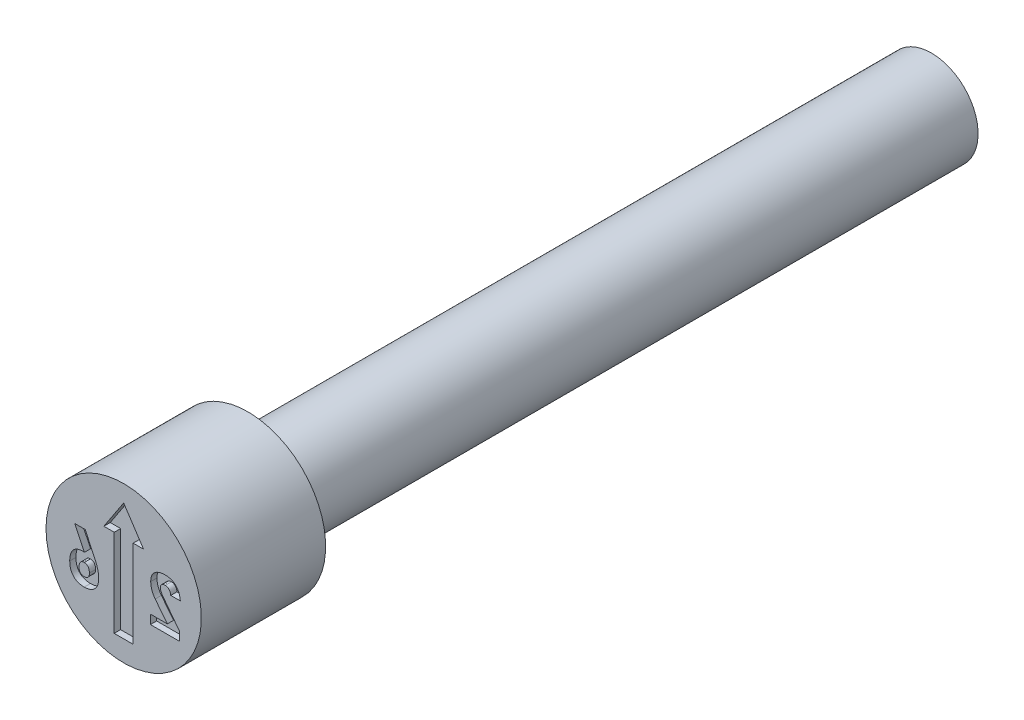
ISO-10303-21;
HEADER;
FILE_DESCRIPTION(('STEP AP214'),'2;1');
FILE_NAME('part.step','',(''),(''),'','','');
FILE_SCHEMA(('AUTOMOTIVE_DESIGN { 1 0 10303 214 1 1 1 1 }'));
ENDSEC;
DATA;
#1=APPLICATION_CONTEXT('core data for automotive mechanical design processes');
#2=APPLICATION_PROTOCOL_DEFINITION('international standard','automotive_design',2000,#1);
#3=PRODUCT_CONTEXT('',#1,'mechanical');
#4=PRODUCT('Part','Part','',(#3));
#5=PRODUCT_RELATED_PRODUCT_CATEGORY('part','',(#4));
#6=PRODUCT_DEFINITION_FORMATION('','',#4);
#7=PRODUCT_DEFINITION_CONTEXT('part definition',#1,'design');
#8=PRODUCT_DEFINITION('design','',#6,#7);
#9=PRODUCT_DEFINITION_SHAPE('','',#8);
#10=(LENGTH_UNIT() NAMED_UNIT(*) SI_UNIT(.MILLI.,.METRE.));
#11=(NAMED_UNIT(*) PLANE_ANGLE_UNIT() SI_UNIT($,.RADIAN.));
#12=(NAMED_UNIT(*) SI_UNIT($,.STERADIAN.) SOLID_ANGLE_UNIT());
#13=UNCERTAINTY_MEASURE_WITH_UNIT(LENGTH_MEASURE(1.E-05),#10,'distance_accuracy_value','');
#14=(GEOMETRIC_REPRESENTATION_CONTEXT(3) GLOBAL_UNCERTAINTY_ASSIGNED_CONTEXT((#13)) GLOBAL_UNIT_ASSIGNED_CONTEXT((#10,
#11,#12)) REPRESENTATION_CONTEXT('',''));
#15=CARTESIAN_POINT('',(0.,0.,0.));
#16=DIRECTION('',(0.,0.,1.));
#17=DIRECTION('',(1.,0.,0.));
#18=AXIS2_PLACEMENT_3D('',#15,#16,#17);
#19=CARTESIAN_POINT('',(0.62499875,0.,0.));
#20=DIRECTION('',(0.,0.,1.));
#21=DIRECTION('',(1.,0.,0.));
#22=AXIS2_PLACEMENT_3D('',#19,#20,#21);
#23=PLANE('',#22);
#24=CARTESIAN_POINT('',(-0.868296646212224,-0.263798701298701,0.));
#25=CARTESIAN_POINT('',(-0.868122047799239,-0.273276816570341,0.));
#26=CARTESIAN_POINT('',(-0.867780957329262,-0.291792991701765,0.));
#27=CARTESIAN_POINT('',(-0.864772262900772,-0.318703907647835,0.));
#28=CARTESIAN_POINT('',(-0.860162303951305,-0.344034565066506,0.));
#29=CARTESIAN_POINT('',(-0.853506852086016,-0.367691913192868,0.));
#30=CARTESIAN_POINT('',(-0.844897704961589,-0.389734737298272,0.));
#31=CARTESIAN_POINT('',(-0.834321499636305,-0.410170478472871,0.));
#32=CARTESIAN_POINT('',(-0.821729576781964,-0.428898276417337,0.));
#33=CARTESIAN_POINT('',(-0.807480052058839,-0.44605391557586,0.));
#34=CARTESIAN_POINT('',(-0.791307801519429,-0.461150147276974,0.));
#35=CARTESIAN_POINT('',(-0.773646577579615,-0.474414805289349,0.));
#36=CARTESIAN_POINT('',(-0.754434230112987,-0.485748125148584,0.));
#37=CARTESIAN_POINT('',(-0.733386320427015,-0.494564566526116,0.));
#38=CARTESIAN_POINT('',(-0.71098436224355,-0.501801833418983,0.));
#39=CARTESIAN_POINT('',(-0.686920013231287,-0.50671787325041,0.));
#40=CARTESIAN_POINT('',(-0.661402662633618,-0.509913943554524,0.));
#41=CARTESIAN_POINT('',(-0.643847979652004,-0.510228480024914,0.));
#42=CARTESIAN_POINT('',(-0.634855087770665,-0.51038961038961,0.));
#43=B_SPLINE_CURVE_WITH_KNOTS('',3,(#24,#25,#26,#27,#28,#29,#30,#31,#32,#33,#34,#35,#36,#37,#38,
#39,#40,#41,#42),.UNSPECIFIED.,.F.,.F.,(4,1,1,1,1,1,1,1,1,1,1,1,1,1,1,1,4),(0.,
0.0736363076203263,0.143853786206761,0.210167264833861,0.273535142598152,0.334525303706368,
0.393774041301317,0.451974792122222,0.509587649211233,0.566708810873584,0.623480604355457,
0.680964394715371,0.739551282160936,0.800463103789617,0.863640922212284,0.930146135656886,1.),.UNSPECIFIED.);
#44=CARTESIAN_POINT('',(-0.868296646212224,-0.263798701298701,0.));
#45=VERTEX_POINT('',#44);
#46=CARTESIAN_POINT('',(-0.634855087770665,-0.51038961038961,0.));
#47=VERTEX_POINT('',#46);
#48=EDGE_CURVE('E54',#45,#47,#43,.T.);
#49=ORIENTED_EDGE('',*,*,#48,.F.);
#50=DIRECTION('',(0.,-1.,0.));
#51=VECTOR('',#50,1.);
#52=CARTESIAN_POINT('',(-0.868296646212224,-0.263149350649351,0.));
#53=LINE('',#52,#51);
#54=CARTESIAN_POINT('',(-0.868296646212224,-0.263149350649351,0.));
#55=VERTEX_POINT('',#54);
#56=EDGE_CURVE('E425',#55,#45,#53,.T.);
#57=ORIENTED_EDGE('',*,*,#56,.F.);
#58=CARTESIAN_POINT('',(-0.660666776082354,-0.0220779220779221,0.));
#59=CARTESIAN_POINT('',(-0.668683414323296,-0.0222596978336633,0.));
#60=CARTESIAN_POINT('',(-0.684285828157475,-0.0226134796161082,0.));
#61=CARTESIAN_POINT('',(-0.70698865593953,-0.0255079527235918,0.));
#62=CARTESIAN_POINT('',(-0.72820615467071,-0.0306372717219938,0.));
#63=CARTESIAN_POINT('',(-0.74820541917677,-0.0373705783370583,0.));
#64=CARTESIAN_POINT('',(-0.766776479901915,-0.0463493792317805,0.));
#65=CARTESIAN_POINT('',(-0.783965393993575,-0.0573359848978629,0.));
#66=CARTESIAN_POINT('',(-0.799812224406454,-0.0701987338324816,0.));
#67=CARTESIAN_POINT('',(-0.814108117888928,-0.0850920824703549,0.));
#68=CARTESIAN_POINT('',(-0.826987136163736,-0.101636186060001,0.));
#69=CARTESIAN_POINT('',(-0.838023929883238,-0.119998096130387,0.));
#70=CARTESIAN_POINT('',(-0.847508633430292,-0.139871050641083,0.));
#71=CARTESIAN_POINT('',(-0.855064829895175,-0.16145377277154,0.));
#72=CARTESIAN_POINT('',(-0.861120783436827,-0.18457091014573,0.));
#73=CARTESIAN_POINT('',(-0.865209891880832,-0.209353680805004,0.));
#74=CARTESIAN_POINT('',(-0.867914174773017,-0.235708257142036,0.));
#75=CARTESIAN_POINT('',(-0.868166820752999,-0.25383479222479,0.));
#76=CARTESIAN_POINT('',(-0.868296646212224,-0.263149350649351,0.));
#77=B_SPLINE_CURVE_WITH_KNOTS('',3,(#58,#59,#60,#61,#62,#63,#64,#65,#66,#67,#68,#69,#70,#71,#72,
#73,#74,#75,#76),.UNSPECIFIED.,.F.,.F.,(4,1,1,1,1,1,1,1,1,1,1,1,1,1,1,1,4),(0.,
0.0665766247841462,0.12957501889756,0.189644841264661,0.247639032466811,0.304530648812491,
0.360514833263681,0.416743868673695,0.473642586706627,0.531631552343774,0.590524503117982,
0.65124161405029,0.714220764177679,0.780176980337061,0.849489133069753,0.922658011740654,1.),.UNSPECIFIED.);
#78=CARTESIAN_POINT('',(-0.660666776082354,-0.0220779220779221,0.));
#79=VERTEX_POINT('',#78);
#80=EDGE_CURVE('E417',#79,#55,#77,.T.);
#81=ORIENTED_EDGE('',*,*,#80,.F.);
#82=CARTESIAN_POINT('',(-0.559205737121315,-0.0766233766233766,0.));
#83=CARTESIAN_POINT('',(-0.561665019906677,-0.0722548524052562,0.));
#84=CARTESIAN_POINT('',(-0.566484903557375,-0.0636930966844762,0.));
#85=CARTESIAN_POINT('',(-0.575979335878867,-0.052612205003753,0.));
#86=CARTESIAN_POINT('',(-0.586568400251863,-0.0429894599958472,0.));
#87=CARTESIAN_POINT('',(-0.598814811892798,-0.0353357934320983,0.));
#88=CARTESIAN_POINT('',(-0.612355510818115,-0.0292805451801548,0.));
#89=CARTESIAN_POINT('',(-0.627301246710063,-0.0251524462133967,0.));
#90=CARTESIAN_POINT('',(-0.64352284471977,-0.0224441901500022,0.));
#91=CARTESIAN_POINT('',(-0.654810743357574,-0.0222030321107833,0.));
#92=CARTESIAN_POINT('',(-0.660666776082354,-0.0220779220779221,0.));
#93=B_SPLINE_CURVE_WITH_KNOTS('',3,(#82,#83,#84,#85,#86,#87,#88,#89,#90,#91,#92),.UNSPECIFIED.,
.F.,.F.,(4,1,1,1,1,1,1,1,4),(0.,0.123274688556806,0.241602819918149,0.357777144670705,
0.474683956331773,0.595870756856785,0.722082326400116,0.855819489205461,1.),.UNSPECIFIED.);
#94=CARTESIAN_POINT('',(-0.631810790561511,-0.0245118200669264,0.));
#95=VERTEX_POINT('',#94);
#96=EDGE_CURVE('E412',#95,#79,#93,.T.);
#97=ORIENTED_EDGE('',*,*,#96,.F.);
#98=DIRECTION('',(0.435377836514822,-0.900247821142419,0.));
#99=VECTOR('',#98,1.);
#100=CARTESIAN_POINT('',(-0.788751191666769,0.3,0.));
#101=LINE('',#100,#99);
#102=CARTESIAN_POINT('',(-0.788751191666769,0.3,0.));
#103=VERTEX_POINT('',#102);
#104=EDGE_CURVE('E409',#103,#95,#101,.T.);
#105=ORIENTED_EDGE('',*,*,#104,.F.);
#106=DIRECTION('',(-1.,0.,0.));
#107=VECTOR('',#106,1.);
#108=CARTESIAN_POINT('',(-0.618945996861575,0.3,0.));
#109=LINE('',#108,#107);
#110=CARTESIAN_POINT('',(-0.618945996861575,0.3,0.));
#111=VERTEX_POINT('',#110);
#112=EDGE_CURVE('E406',#111,#103,#109,.T.);
#113=ORIENTED_EDGE('',*,*,#112,.F.);
#114=DIRECTION('',(-0.424073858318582,0.905627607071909,0.));
#115=VECTOR('',#114,1.);
#116=CARTESIAN_POINT('',(-0.457257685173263,-0.0452922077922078,0.));
#117=LINE('',#116,#115);
#118=CARTESIAN_POINT('',(-0.457257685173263,-0.0452922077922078,0.));
#119=VERTEX_POINT('',#118);
#120=EDGE_CURVE('E400',#119,#111,#117,.T.);
#121=ORIENTED_EDGE('',*,*,#120,.F.);
#122=CARTESIAN_POINT('',(-0.402062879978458,-0.267694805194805,0.));
#123=CARTESIAN_POINT('',(-0.40226770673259,-0.258921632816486,0.));
#124=CARTESIAN_POINT('',(-0.402684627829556,-0.241064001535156,0.));
#125=CARTESIAN_POINT('',(-0.405592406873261,-0.213960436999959,0.));
#126=CARTESIAN_POINT('',(-0.410085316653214,-0.186131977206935,0.));
#127=CARTESIAN_POINT('',(-0.416675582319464,-0.157827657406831,0.));
#128=CARTESIAN_POINT('',(-0.424711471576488,-0.129337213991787,0.));
#129=CARTESIAN_POINT('',(-0.434230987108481,-0.100988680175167,0.));
#130=CARTESIAN_POINT('',(-0.444816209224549,-0.0728488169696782,0.));
#131=CARTESIAN_POINT('',(-0.453098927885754,-0.0545034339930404,0.));
#132=CARTESIAN_POINT('',(-0.457257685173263,-0.0452922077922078,0.));
#133=B_SPLINE_CURVE_WITH_KNOTS('',3,(#122,#123,#124,#125,#126,#127,#128,#129,#130,#131,#132),
.UNSPECIFIED.,.F.,.F.,(4,1,1,1,1,1,1,1,4),(0.,0.114002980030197,0.232050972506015,
0.353906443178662,0.480147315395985,0.609491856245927,0.738474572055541,0.868687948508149,1.),.UNSPECIFIED.);
#134=CARTESIAN_POINT('',(-0.402062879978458,-0.267694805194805,0.));
#135=VERTEX_POINT('',#134);
#136=EDGE_CURVE('E395',#135,#119,#133,.T.);
#137=ORIENTED_EDGE('',*,*,#136,.F.);
#138=DIRECTION('',(0.,1.,0.));
#139=VECTOR('',#138,1.);
#140=CARTESIAN_POINT('',(-0.402062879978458,-0.268181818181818,0.));
#141=LINE('',#140,#139);
#142=CARTESIAN_POINT('',(-0.402062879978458,-0.268181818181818,0.));
#143=VERTEX_POINT('',#142);
#144=EDGE_CURVE('E389',#143,#135,#141,.T.);
#145=ORIENTED_EDGE('',*,*,#144,.F.);
#146=CARTESIAN_POINT('',(-0.634855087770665,-0.51038961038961,0.));
#147=CARTESIAN_POINT('',(-0.625864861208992,-0.510209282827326,0.));
#148=CARTESIAN_POINT('',(-0.608375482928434,-0.509858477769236,0.));
#149=CARTESIAN_POINT('',(-0.582933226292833,-0.506949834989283,0.));
#150=CARTESIAN_POINT('',(-0.559084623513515,-0.501897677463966,0.));
#151=CARTESIAN_POINT('',(-0.536724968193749,-0.494925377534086,0.));
#152=CARTESIAN_POINT('',(-0.515853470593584,-0.486012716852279,0.));
#153=CARTESIAN_POINT('',(-0.496562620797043,-0.475085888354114,0.));
#154=CARTESIAN_POINT('',(-0.478842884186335,-0.462137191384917,0.));
#155=CARTESIAN_POINT('',(-0.462783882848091,-0.447194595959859,0.));
#156=CARTESIAN_POINT('',(-0.448498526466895,-0.43044449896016,0.));
#157=CARTESIAN_POINT('',(-0.436020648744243,-0.41205051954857,0.));
#158=CARTESIAN_POINT('',(-0.425455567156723,-0.392018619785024,0.));
#159=CARTESIAN_POINT('',(-0.416886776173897,-0.370338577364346,0.));
#160=CARTESIAN_POINT('',(-0.410165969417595,-0.347077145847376,0.));
#161=CARTESIAN_POINT('',(-0.405620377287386,-0.322218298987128,0.));
#162=CARTESIAN_POINT('',(-0.402558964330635,-0.295746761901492,0.));
#163=CARTESIAN_POINT('',(-0.402231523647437,-0.277552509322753,0.));
#164=CARTESIAN_POINT('',(-0.402062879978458,-0.268181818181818,0.));
#165=B_SPLINE_CURVE_WITH_KNOTS('',3,(#146,#147,#148,#149,#150,#151,#152,#153,#154,#155,#156,
#157,#158,#159,#160,#161,#162,#163,#164),.UNSPECIFIED.,.F.,.F.,(4,1,1,1,1,1,1,1,1,1,1,1,1,1,1,1,
4),(0.,0.0706034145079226,0.137350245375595,0.20079014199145,0.261822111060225,
0.321037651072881,0.37871381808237,0.435588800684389,0.493032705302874,0.550614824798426,
0.60814515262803,0.667276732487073,0.728130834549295,0.790952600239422,0.857142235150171,
0.926423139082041,1.),.UNSPECIFIED.);
#166=EDGE_CURVE('E381',#47,#143,#165,.T.);
#167=ORIENTED_EDGE('',*,*,#166,.F.);
#168=EDGE_LOOP('',(#49,#57,#81,#97,#105,#113,#121,#137,#145,#167));
#169=FACE_BOUND('',#168,.T.);
#170=DIRECTION('',(1.,0.,0.));
#171=VECTOR('',#170,1.);
#172=CARTESIAN_POINT('',(0.43070984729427,-0.5,0.));
#173=LINE('',#172,#171);
#174=CARTESIAN_POINT('',(0.43070984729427,-0.5,0.));
#175=VERTEX_POINT('',#174);
#176=CARTESIAN_POINT('',(0.901813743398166,-0.5,0.));
#177=VERTEX_POINT('',#176);
#178=EDGE_CURVE('E434',#175,#177,#173,.T.);
#179=ORIENTED_EDGE('',*,*,#178,.F.);
#180=DIRECTION('',(0.,-1.,0.));
#181=VECTOR('',#180,1.);
#182=CARTESIAN_POINT('',(0.43070984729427,-0.354545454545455,0.));
#183=LINE('',#182,#181);
#184=CARTESIAN_POINT('',(0.43070984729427,-0.354545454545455,0.));
#185=VERTEX_POINT('',#184);
#186=EDGE_CURVE('E456',#185,#175,#183,.T.);
#187=ORIENTED_EDGE('',*,*,#186,.F.);
#188=DIRECTION('',(-1.,0.,0.));
#189=VECTOR('',#188,1.);
#190=CARTESIAN_POINT('',(0.70295010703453,-0.354545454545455,0.));
#191=LINE('',#190,#189);
#192=CARTESIAN_POINT('',(0.70295010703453,-0.354545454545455,0.));
#193=VERTEX_POINT('',#192);
#194=EDGE_CURVE('E673',#193,#185,#191,.T.);
#195=ORIENTED_EDGE('',*,*,#194,.F.);
#196=DIRECTION('',(0.618183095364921,-0.786034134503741,0.));
#197=VECTOR('',#196,1.);
#198=CARTESIAN_POINT('',(0.506846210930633,-0.105194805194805,0.));
#199=LINE('',#198,#197);
#200=CARTESIAN_POINT('',(0.506846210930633,-0.105194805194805,0.));
#201=VERTEX_POINT('',#200);
#202=EDGE_CURVE('E676',#201,#193,#199,.T.);
#203=ORIENTED_EDGE('',*,*,#202,.F.);
#204=CARTESIAN_POINT('',(0.435092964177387,0.100649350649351,0.));
#205=CARTESIAN_POINT('',(0.43529993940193,0.0915468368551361,0.));
#206=CARTESIAN_POINT('',(0.435714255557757,0.0733257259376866,0.));
#207=CARTESIAN_POINT('',(0.439454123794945,0.0460552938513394,0.));
#208=CARTESIAN_POINT('',(0.445480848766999,0.0189240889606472,0.));
#209=CARTESIAN_POINT('',(0.453757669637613,-0.00793681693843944,0.));
#210=CARTESIAN_POINT('',(0.464039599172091,-0.0340621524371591,0.));
#211=CARTESIAN_POINT('',(0.476379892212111,-0.0590941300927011,0.));
#212=CARTESIAN_POINT('',(0.490307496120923,-0.0830438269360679,0.));
#213=CARTESIAN_POINT('',(0.501343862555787,-0.0978252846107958,0.));
#214=CARTESIAN_POINT('',(0.506846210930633,-0.105194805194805,0.));
#215=B_SPLINE_CURVE_WITH_KNOTS('',3,(#204,#205,#206,#207,#208,#209,#210,#211,#212,#213,#214),
.UNSPECIFIED.,.F.,.F.,(4,1,1,1,1,1,1,1,4),(0.,0.123046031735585,0.246309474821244,
0.371480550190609,0.498560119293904,0.626024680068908,0.750715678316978,0.875715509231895,1.),.UNSPECIFIED.);
#216=CARTESIAN_POINT('',(0.435092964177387,0.100649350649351,0.));
#217=VERTEX_POINT('',#216);
#218=EDGE_CURVE('E679',#217,#201,#215,.T.);
#219=ORIENTED_EDGE('',*,*,#218,.F.);
#220=DIRECTION('',(0.,-1.,0.));
#221=VECTOR('',#220,1.);
#222=CARTESIAN_POINT('',(0.435092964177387,0.101298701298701,0.));
#223=LINE('',#222,#221);
#224=CARTESIAN_POINT('',(0.435092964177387,0.101298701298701,0.));
#225=VERTEX_POINT('',#224);
#226=EDGE_CURVE('E684',#225,#217,#223,.T.);
#227=ORIENTED_EDGE('',*,*,#226,.F.);
#228=CARTESIAN_POINT('',(0.670644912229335,0.31038961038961,0.));
#229=CARTESIAN_POINT('',(0.661546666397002,0.310260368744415,0.));
#230=CARTESIAN_POINT('',(0.643851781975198,0.310009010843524,0.));
#231=CARTESIAN_POINT('',(0.618091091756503,0.307295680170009,0.));
#232=CARTESIAN_POINT('',(0.593853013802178,0.303200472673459,0.));
#233=CARTESIAN_POINT('',(0.571176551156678,0.297209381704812,0.));
#234=CARTESIAN_POINT('',(0.550152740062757,0.289394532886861,0.));
#235=CARTESIAN_POINT('',(0.530718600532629,0.27997174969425,0.));
#236=CARTESIAN_POINT('',(0.512833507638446,0.268860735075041,0.));
#237=CARTESIAN_POINT('',(0.496634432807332,0.256037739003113,0.));
#238=CARTESIAN_POINT('',(0.482059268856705,0.241735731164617,0.));
#239=CARTESIAN_POINT('',(0.469513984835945,0.225809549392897,0.));
#240=CARTESIAN_POINT('',(0.458653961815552,0.208581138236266,0.));
#241=CARTESIAN_POINT('',(0.450164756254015,0.189716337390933,0.));
#242=CARTESIAN_POINT('',(0.44317575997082,0.169658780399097,0.));
#243=CARTESIAN_POINT('',(0.438650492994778,0.148048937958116,0.));
#244=CARTESIAN_POINT('',(0.435601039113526,0.125141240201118,0.));
#245=CARTESIAN_POINT('',(0.43526500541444,0.109372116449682,0.));
#246=CARTESIAN_POINT('',(0.435092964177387,0.101298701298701,0.));
#247=B_SPLINE_CURVE_WITH_KNOTS('',3,(#228,#229,#230,#231,#232,#233,#234,#235,#236,#237,#238,
#239,#240,#241,#242,#243,#244,#245,#246),.UNSPECIFIED.,.F.,.F.,(4,1,1,1,1,1,1,1,1,1,1,1,1,1,1,1,
4),(0.,0.0762312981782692,0.148259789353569,0.216860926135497,0.282100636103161,
0.344528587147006,0.404571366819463,0.462840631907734,0.520642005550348,0.577409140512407,
0.633580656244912,0.690215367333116,0.747647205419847,0.806597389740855,0.867894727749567,
0.932365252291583,1.),.UNSPECIFIED.);
#248=CARTESIAN_POINT('',(0.670644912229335,0.31038961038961,0.));
#249=VERTEX_POINT('',#248);
#250=EDGE_CURVE('E690',#249,#225,#247,.T.);
#251=ORIENTED_EDGE('',*,*,#250,.F.);
#252=CARTESIAN_POINT('',(0.911716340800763,0.0702922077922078,0.));
#253=CARTESIAN_POINT('',(0.910956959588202,0.0795653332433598,0.));
#254=CARTESIAN_POINT('',(0.909474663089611,0.0976662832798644,0.));
#255=CARTESIAN_POINT('',(0.904615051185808,0.123850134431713,0.));
#256=CARTESIAN_POINT('',(0.898334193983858,0.14851353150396,0.));
#257=CARTESIAN_POINT('',(0.890344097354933,0.171651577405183,0.));
#258=CARTESIAN_POINT('',(0.880076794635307,0.192996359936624,0.));
#259=CARTESIAN_POINT('',(0.868541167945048,0.2129940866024,0.));
#260=CARTESIAN_POINT('',(0.854666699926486,0.231026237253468,0.));
#261=CARTESIAN_POINT('',(0.839479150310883,0.247696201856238,0.));
#262=CARTESIAN_POINT('',(0.822562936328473,0.26237886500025,0.));
#263=CARTESIAN_POINT('',(0.804525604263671,0.27533094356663,0.));
#264=CARTESIAN_POINT('',(0.78509440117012,0.286109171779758,0.));
#265=CARTESIAN_POINT('',(0.764564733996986,0.295050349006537,0.));
#266=CARTESIAN_POINT('',(0.742708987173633,0.301836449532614,0.));
#267=CARTESIAN_POINT('',(0.719812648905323,0.306919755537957,0.));
#268=CARTESIAN_POINT('',(0.695612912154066,0.309851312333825,0.));
#269=CARTESIAN_POINT('',(0.679094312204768,0.310207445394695,0.));
#270=CARTESIAN_POINT('',(0.670644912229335,0.31038961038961,0.));
#271=B_SPLINE_CURVE_WITH_KNOTS('',3,(#252,#253,#254,#255,#256,#257,#258,#259,#260,#261,#262,
#263,#264,#265,#266,#267,#268,#269,#270),.UNSPECIFIED.,.F.,.F.,(4,1,1,1,1,1,1,1,1,1,1,1,1,1,1,1,
4),(0.,0.073326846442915,0.14313249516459,0.209679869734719,0.273918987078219,0.335762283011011,
0.396210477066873,0.45560885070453,0.514796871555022,0.573764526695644,0.631900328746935,
0.689592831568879,0.748648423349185,0.808163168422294,0.86976604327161,0.933384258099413,1.),.UNSPECIFIED.);
#272=CARTESIAN_POINT('',(0.911716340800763,0.0702922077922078,0.));
#273=VERTEX_POINT('',#272);
#274=EDGE_CURVE('E695',#273,#249,#271,.T.);
#275=ORIENTED_EDGE('',*,*,#274,.F.);
#276=DIRECTION('',(0.,1.,0.));
#277=VECTOR('',#276,1.);
#278=CARTESIAN_POINT('',(0.911716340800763,0.0698051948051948,0.));
#279=LINE('',#278,#277);
#280=CARTESIAN_POINT('',(0.911716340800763,0.0698051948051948,0.));
#281=VERTEX_POINT('',#280);
#282=EDGE_CURVE('E703',#281,#273,#279,.T.);
#283=ORIENTED_EDGE('',*,*,#282,.F.);
#284=DIRECTION('',(1.,0.,0.));
#285=VECTOR('',#284,1.);
#286=CARTESIAN_POINT('',(0.757820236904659,0.0698051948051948,0.));
#287=LINE('',#286,#285);
#288=CARTESIAN_POINT('',(0.757820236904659,0.0698051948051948,0.));
#289=VERTEX_POINT('',#288);
#290=EDGE_CURVE('E709',#289,#281,#287,.T.);
#291=ORIENTED_EDGE('',*,*,#290,.F.);
#292=DIRECTION('',(0.,-1.,0.));
#293=VECTOR('',#292,1.);
#294=CARTESIAN_POINT('',(0.757820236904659,0.0702922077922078,0.));
#295=LINE('',#294,#293);
#296=CARTESIAN_POINT('',(0.75782023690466,0.0702922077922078,0.));
#297=VERTEX_POINT('',#296);
#298=EDGE_CURVE('E712',#297,#289,#295,.T.);
#299=ORIENTED_EDGE('',*,*,#298,.F.);
#300=CARTESIAN_POINT('',(0.669508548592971,0.164935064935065,0.));
#301=CARTESIAN_POINT('',(0.675389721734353,0.164705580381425,0.));
#302=CARTESIAN_POINT('',(0.686817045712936,0.164259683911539,0.));
#303=CARTESIAN_POINT('',(0.702994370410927,0.159317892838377,0.));
#304=CARTESIAN_POINT('',(0.717571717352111,0.151566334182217,0.));
#305=CARTESIAN_POINT('',(0.730138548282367,0.140505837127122,0.));
#306=CARTESIAN_POINT('',(0.740544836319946,0.126618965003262,0.));
#307=CARTESIAN_POINT('',(0.748990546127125,0.110266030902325,0.));
#308=CARTESIAN_POINT('',(0.75472680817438,0.0911517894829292,0.));
#309=CARTESIAN_POINT('',(0.756755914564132,0.0774691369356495,0.));
#310=CARTESIAN_POINT('',(0.75782023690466,0.0702922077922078,0.));
#311=B_SPLINE_CURVE_WITH_KNOTS('',3,(#300,#301,#302,#303,#304,#305,#306,#307,#308,#309,#310),
.UNSPECIFIED.,.F.,.F.,(4,1,1,1,1,1,1,1,4),(0.,0.122603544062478,0.238222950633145,
0.350089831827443,0.465559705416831,0.58502806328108,0.711014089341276,0.848418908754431,1.),.UNSPECIFIED.);
#312=CARTESIAN_POINT('',(0.669508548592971,0.164935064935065,0.));
#313=VERTEX_POINT('',#312);
#314=EDGE_CURVE('E715',#313,#297,#311,.T.);
#315=ORIENTED_EDGE('',*,*,#314,.F.);
#316=CARTESIAN_POINT('',(0.589638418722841,0.0970779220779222,0.));
#317=CARTESIAN_POINT('',(0.589860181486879,0.102193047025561,0.));
#318=CARTESIAN_POINT('',(0.590285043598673,0.11199281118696,0.));
#319=CARTESIAN_POINT('',(0.59428791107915,0.125800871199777,0.));
#320=CARTESIAN_POINT('',(0.600848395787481,0.137825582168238,0.));
#321=CARTESIAN_POINT('',(0.610244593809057,0.147757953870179,0.));
#322=CARTESIAN_POINT('',(0.621942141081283,0.155613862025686,0.));
#323=CARTESIAN_POINT('',(0.635938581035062,0.161150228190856,0.));
#324=CARTESIAN_POINT('',(0.652050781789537,0.164324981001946,0.));
#325=CARTESIAN_POINT('',(0.663487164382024,0.164724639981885,0.));
#326=CARTESIAN_POINT('',(0.669508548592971,0.164935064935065,0.));
#327=B_SPLINE_CURVE_WITH_KNOTS('',3,(#316,#317,#318,#319,#320,#321,#322,#323,#324,#325,#326),
.UNSPECIFIED.,.F.,.F.,(4,1,1,1,1,1,1,1,4),(0.,0.128749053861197,0.246662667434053,
0.359069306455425,0.47107757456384,0.588039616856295,0.711712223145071,0.848213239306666,1.),.UNSPECIFIED.);
#328=CARTESIAN_POINT('',(0.589638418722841,0.0970779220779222,0.));
#329=VERTEX_POINT('',#328);
#330=EDGE_CURVE('E720',#329,#313,#327,.T.);
#331=ORIENTED_EDGE('',*,*,#330,.F.);
#332=DIRECTION('',(0.,1.,0.));
#333=VECTOR('',#332,1.);
#334=CARTESIAN_POINT('',(0.589638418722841,0.0959415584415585,0.));
#335=LINE('',#334,#333);
#336=CARTESIAN_POINT('',(0.589638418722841,0.0959415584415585,0.));
#337=VERTEX_POINT('',#336);
#338=EDGE_CURVE('E728',#337,#329,#335,.T.);
#339=ORIENTED_EDGE('',*,*,#338,.F.);
#340=CARTESIAN_POINT('',(0.628437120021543,-0.00178571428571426,0.));
#341=CARTESIAN_POINT('',(0.622711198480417,0.00628241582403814,0.));
#342=CARTESIAN_POINT('',(0.611554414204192,0.0220029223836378,0.));
#343=CARTESIAN_POINT('',(0.601456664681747,0.0435918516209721,0.));
#344=CARTESIAN_POINT('',(0.595166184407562,0.060517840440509,0.));
#345=CARTESIAN_POINT('',(0.592168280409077,0.0727925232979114,0.));
#346=CARTESIAN_POINT('',(0.590029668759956,0.0845037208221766,0.));
#347=CARTESIAN_POINT('',(0.58976644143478,0.0921989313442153,0.));
#348=CARTESIAN_POINT('',(0.589638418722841,0.0959415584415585,0.));
#349=B_SPLINE_CURVE_WITH_KNOTS('',3,(#340,#341,#342,#343,#344,#345,#346,#347,#348),
.UNSPECIFIED.,.F.,.F.,(4,1,1,1,1,1,4),(0.,0.277375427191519,0.540457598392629,0.666416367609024,
0.784009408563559,0.894951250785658,1.),.UNSPECIFIED.);
#350=CARTESIAN_POINT('',(0.628437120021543,-0.00178571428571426,0.));
#351=VERTEX_POINT('',#350);
#352=EDGE_CURVE('E734',#351,#337,#349,.T.);
#353=ORIENTED_EDGE('',*,*,#352,.F.);
#354=DIRECTION('',(-0.602458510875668,0.798150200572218,0.));
#355=VECTOR('',#354,1.);
#356=CARTESIAN_POINT('',(0.901813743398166,-0.363961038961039,0.));
#357=LINE('',#356,#355);
#358=CARTESIAN_POINT('',(0.901813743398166,-0.363961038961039,0.));
#359=VERTEX_POINT('',#358);
#360=EDGE_CURVE('E739',#359,#351,#357,.T.);
#361=ORIENTED_EDGE('',*,*,#360,.F.);
#362=DIRECTION('',(0.,1.,0.));
#363=VECTOR('',#362,1.);
#364=CARTESIAN_POINT('',(0.901813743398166,-0.5,0.));
#365=LINE('',#364,#363);
#366=EDGE_CURVE('E745',#177,#359,#365,.T.);
#367=ORIENTED_EDGE('',*,*,#366,.F.);
#368=EDGE_LOOP('',(#179,#187,#195,#203,#219,#227,#251,#275,#283,#291,#299,#315,#331,#339,#353,
#361,#367));
#369=FACE_BOUND('',#368,.T.);
#370=CARTESIAN_POINT('',(0.,0.,0.));
#371=DIRECTION('',(0.,0.,-1.));
#372=DIRECTION('',(-1.,0.,0.));
#373=AXIS2_PLACEMENT_3D('',#370,#371,#372);
#374=CIRCLE('',#373,1.2499975);
#375=CARTESIAN_POINT('',(-1.2499975,0.,0.));
#376=VERTEX_POINT('',#375);
#377=EDGE_CURVE('E41',#376,#376,#374,.T.);
#378=ORIENTED_EDGE('',*,*,#377,.F.);
#379=EDGE_LOOP('',(#378));
#380=FACE_BOUND('',#379,.T.);
#381=DIRECTION('',(0.,1.,0.));
#382=VECTOR('',#381,1.);
#383=CARTESIAN_POINT('',(0.1524,0.,0.));
#384=LINE('',#383,#382);
#385=CARTESIAN_POINT('',(0.1524,0.495314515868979,0.));
#386=VERTEX_POINT('',#385);
#387=CARTESIAN_POINT('',(0.1524,-0.9144,0.));
#388=VERTEX_POINT('',#387);
#389=EDGE_CURVE('E564',#386,#388,#384,.F.);
#390=ORIENTED_EDGE('',*,*,#389,.T.);
#391=DIRECTION('',(1.,0.,0.));
#392=VECTOR('',#391,1.);
#393=CARTESIAN_POINT('',(0.62499875,-0.9144,0.));
#394=LINE('',#393,#392);
#395=CARTESIAN_POINT('',(-0.1524,-0.9144,0.));
#396=VERTEX_POINT('',#395);
#397=EDGE_CURVE('E567',#388,#396,#394,.F.);
#398=ORIENTED_EDGE('',*,*,#397,.T.);
#399=DIRECTION('',(0.,1.,0.));
#400=VECTOR('',#399,1.);
#401=CARTESIAN_POINT('',(-0.1524,0.,0.));
#402=LINE('',#401,#400);
#403=CARTESIAN_POINT('',(-0.1524,0.495314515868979,0.));
#404=VERTEX_POINT('',#403);
#405=EDGE_CURVE('E585',#396,#404,#402,.T.);
#406=ORIENTED_EDGE('',*,*,#405,.T.);
#407=DIRECTION('',(1.,0.,0.));
#408=VECTOR('',#407,1.);
#409=CARTESIAN_POINT('',(0.62499875,0.495314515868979,0.));
#410=LINE('',#409,#408);
#411=CARTESIAN_POINT('',(-0.31923088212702,0.495314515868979,0.));
#412=VERTEX_POINT('',#411);
#413=EDGE_CURVE('E582',#404,#412,#410,.F.);
#414=ORIENTED_EDGE('',*,*,#413,.T.);
#415=DIRECTION('',(0.550159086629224,0.835059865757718,0.));
#416=VECTOR('',#415,1.);
#417=CARTESIAN_POINT('',(-0.319230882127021,0.495314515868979,0.));
#418=LINE('',#417,#416);
#419=CARTESIAN_POINT('',(0.,0.979859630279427,0.));
#420=VERTEX_POINT('',#419);
#421=EDGE_CURVE('E579',#412,#420,#418,.T.);
#422=ORIENTED_EDGE('',*,*,#421,.T.);
#423=DIRECTION('',(0.550159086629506,-0.835059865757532,0.));
#424=VECTOR('',#423,1.);
#425=CARTESIAN_POINT('',(0.,0.979859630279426,0.));
#426=LINE('',#425,#424);
#427=CARTESIAN_POINT('',(0.319230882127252,0.495314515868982,0.));
#428=VERTEX_POINT('',#427);
#429=EDGE_CURVE('E574',#420,#428,#426,.T.);
#430=ORIENTED_EDGE('',*,*,#429,.T.);
#431=DIRECTION('',(1.,0.,0.));
#432=VECTOR('',#431,1.);
#433=CARTESIAN_POINT('',(0.62499875,0.495314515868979,0.));
#434=LINE('',#433,#432);
#435=EDGE_CURVE('E570',#428,#386,#434,.F.);
#436=ORIENTED_EDGE('',*,*,#435,.T.);
#437=EDGE_LOOP('',(#390,#398,#406,#414,#422,#430,#436));
#438=FACE_BOUND('',#437,.T.);
#439=ADVANCED_FACE('F37',(#169,#369,#380,#438),#23,.T.);
#440=CARTESIAN_POINT('',(-0.1524,0.495314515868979,-1.6556487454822));
#441=DIRECTION('',(-1.,0.,0.));
#442=DIRECTION('',(0.,-1.,0.));
#443=AXIS2_PLACEMENT_3D('',#440,#441,#442);
#444=PLANE('',#443);
#445=DIRECTION('',(0.,-1.,0.));
#446=VECTOR('',#445,1.);
#447=CARTESIAN_POINT('',(-0.1524,0.495314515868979,-0.10335957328));
#448=LINE('',#447,#446);
#449=CARTESIAN_POINT('',(-0.1524,0.495314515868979,-0.10335957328));
#450=VERTEX_POINT('',#449);
#451=CARTESIAN_POINT('',(-0.1524,-0.9144,-0.10335957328));
#452=VERTEX_POINT('',#451);
#453=EDGE_CURVE('E620',#450,#452,#448,.T.);
#454=ORIENTED_EDGE('',*,*,#453,.F.);
#455=DIRECTION('',(0.,0.,1.));
#456=VECTOR('',#455,1.);
#457=CARTESIAN_POINT('',(-0.1524,0.495314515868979,-0.10667978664));
#458=LINE('',#457,#456);
#459=EDGE_CURVE('E601',#404,#450,#458,.F.);
#460=ORIENTED_EDGE('',*,*,#459,.F.);
#461=ORIENTED_EDGE('',*,*,#405,.F.);
#462=DIRECTION('',(0.,0.,-1.));
#463=VECTOR('',#462,1.);
#464=CARTESIAN_POINT('',(-0.1524,-0.9144,-1.6556487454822));
#465=LINE('',#464,#463);
#466=EDGE_CURVE('E587',#396,#452,#465,.T.);
#467=ORIENTED_EDGE('',*,*,#466,.T.);
#468=EDGE_LOOP('',(#454,#460,#461,#467));
#469=FACE_BOUND('',#468,.T.);
#470=ADVANCED_FACE('F39',(#469),#444,.F.);
#471=CARTESIAN_POINT('',(2.096096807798E-13,0.495314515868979,-0.10667978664));
#472=DIRECTION('',(0.,1.,0.));
#473=DIRECTION('',(0.,0.,1.));
#474=AXIS2_PLACEMENT_3D('',#471,#472,#473);
#475=PLANE('',#474);
#476=ORIENTED_EDGE('',*,*,#459,.T.);
#477=DIRECTION('',(1.,0.,0.));
#478=VECTOR('',#477,1.);
#479=CARTESIAN_POINT('',(-0.31923088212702,0.495314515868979,-0.10335957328));
#480=LINE('',#479,#478);
#481=CARTESIAN_POINT('',(-0.319230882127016,0.495314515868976,-0.10335957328));
#482=VERTEX_POINT('',#481);
#483=EDGE_CURVE('E625',#482,#450,#480,.T.);
#484=ORIENTED_EDGE('',*,*,#483,.F.);
#485=DIRECTION('',(0.,0.,1.));
#486=VECTOR('',#485,1.);
#487=CARTESIAN_POINT('',(-0.319230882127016,0.495314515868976,-0.48767902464));
#488=LINE('',#487,#486);
#489=EDGE_CURVE('E599',#482,#412,#488,.T.);
#490=ORIENTED_EDGE('',*,*,#489,.T.);
#491=ORIENTED_EDGE('',*,*,#413,.F.);
#492=EDGE_LOOP('',(#476,#484,#490,#491));
#493=FACE_BOUND('',#492,.T.);
#494=ADVANCED_FACE('F537',(#493),#475,.T.);
#495=CARTESIAN_POINT('',(-0.54143825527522,0.158036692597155,-0.48767902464));
#496=DIRECTION('',(-0.835059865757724,0.550159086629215,0.));
#497=DIRECTION('',(-0.550159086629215,-0.835059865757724,0.));
#498=AXIS2_PLACEMENT_3D('',#495,#496,#497);
#499=PLANE('',#498);
#500=DIRECTION('',(-0.550159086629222,-0.835059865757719,0.));
#501=VECTOR('',#500,1.);
#502=CARTESIAN_POINT('',(0.,0.979859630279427,-0.10335957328));
#503=LINE('',#502,#501);
#504=CARTESIAN_POINT('',(0.,0.979859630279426,-0.10335957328));
#505=VERTEX_POINT('',#504);
#506=EDGE_CURVE('E627',#505,#482,#503,.T.);
#507=ORIENTED_EDGE('',*,*,#506,.F.);
#508=DIRECTION('',(0.,0.,1.));
#509=VECTOR('',#508,1.);
#510=CARTESIAN_POINT('',(0.,0.979859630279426,-0.48767902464));
#511=LINE('',#510,#509);
#512=EDGE_CURVE('E597',#505,#420,#511,.T.);
#513=ORIENTED_EDGE('',*,*,#512,.T.);
#514=ORIENTED_EDGE('',*,*,#421,.F.);
#515=ORIENTED_EDGE('',*,*,#489,.F.);
#516=EDGE_LOOP('',(#507,#513,#514,#515));
#517=FACE_BOUND('',#516,.T.);
#518=ADVANCED_FACE('F534',(#517),#499,.F.);
#519=CARTESIAN_POINT('',(0.,0.979859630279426,-0.48767902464));
#520=DIRECTION('',(0.835059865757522,0.550159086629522,0.));
#521=DIRECTION('',(-0.550159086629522,0.835059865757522,0.));
#522=AXIS2_PLACEMENT_3D('',#519,#520,#521);
#523=PLANE('',#522);
#524=DIRECTION('',(-0.550159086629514,0.835059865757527,0.));
#525=VECTOR('',#524,1.);
#526=CARTESIAN_POINT('',(0.319230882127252,0.495314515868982,-0.10335957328));
#527=LINE('',#526,#525);
#528=CARTESIAN_POINT('',(0.319230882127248,0.495314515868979,-0.10335957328));
#529=VERTEX_POINT('',#528);
#530=EDGE_CURVE('E630',#529,#505,#527,.T.);
#531=ORIENTED_EDGE('',*,*,#530,.F.);
#532=DIRECTION('',(0.,0.,1.));
#533=VECTOR('',#532,1.);
#534=CARTESIAN_POINT('',(0.319230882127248,0.495314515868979,-0.10667978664));
#535=LINE('',#534,#533);
#536=EDGE_CURVE('E594',#428,#529,#535,.F.);
#537=ORIENTED_EDGE('',*,*,#536,.F.);
#538=ORIENTED_EDGE('',*,*,#429,.F.);
#539=ORIENTED_EDGE('',*,*,#512,.F.);
#540=EDGE_LOOP('',(#531,#537,#538,#539));
#541=FACE_BOUND('',#540,.T.);
#542=ADVANCED_FACE('F530',(#541),#523,.F.);
#543=CARTESIAN_POINT('',(2.096096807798E-13,0.495314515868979,-0.10667978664));
#544=DIRECTION('',(0.,1.,0.));
#545=DIRECTION('',(0.,0.,1.));
#546=AXIS2_PLACEMENT_3D('',#543,#544,#545);
#547=PLANE('',#546);
#548=ORIENTED_EDGE('',*,*,#536,.T.);
#549=DIRECTION('',(1.,0.,0.));
#550=VECTOR('',#549,1.);
#551=CARTESIAN_POINT('',(0.1524,0.495314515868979,-0.10335957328));
#552=LINE('',#551,#550);
#553=CARTESIAN_POINT('',(0.1524,0.495314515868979,-0.10335957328));
#554=VERTEX_POINT('',#553);
#555=EDGE_CURVE('E633',#554,#529,#552,.T.);
#556=ORIENTED_EDGE('',*,*,#555,.F.);
#557=DIRECTION('',(0.,0.,1.));
#558=VECTOR('',#557,1.);
#559=CARTESIAN_POINT('',(0.1524,0.495314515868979,-1.6556487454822));
#560=LINE('',#559,#558);
#561=EDGE_CURVE('E592',#554,#386,#560,.T.);
#562=ORIENTED_EDGE('',*,*,#561,.T.);
#563=ORIENTED_EDGE('',*,*,#435,.F.);
#564=EDGE_LOOP('',(#548,#556,#562,#563));
#565=FACE_BOUND('',#564,.T.);
#566=ADVANCED_FACE('F526',(#565),#547,.T.);
#567=CARTESIAN_POINT('',(0.1524,0.495314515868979,-1.6556487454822));
#568=DIRECTION('',(1.,0.,0.));
#569=DIRECTION('',(0.,1.,0.));
#570=AXIS2_PLACEMENT_3D('',#567,#568,#569);
#571=PLANE('',#570);
#572=DIRECTION('',(0.,1.,0.));
#573=VECTOR('',#572,1.);
#574=CARTESIAN_POINT('',(0.1524,-0.9144,-0.10335957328));
#575=LINE('',#574,#573);
#576=CARTESIAN_POINT('',(0.1524,-0.9144,-0.10335957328));
#577=VERTEX_POINT('',#576);
#578=EDGE_CURVE('E602',#577,#554,#575,.T.);
#579=ORIENTED_EDGE('',*,*,#578,.F.);
#580=DIRECTION('',(0.,0.,-1.));
#581=VECTOR('',#580,1.);
#582=CARTESIAN_POINT('',(0.1524,-0.9144,-1.6556487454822));
#583=LINE('',#582,#581);
#584=EDGE_CURVE('E590',#577,#388,#583,.F.);
#585=ORIENTED_EDGE('',*,*,#584,.T.);
#586=ORIENTED_EDGE('',*,*,#389,.F.);
#587=ORIENTED_EDGE('',*,*,#561,.F.);
#588=EDGE_LOOP('',(#579,#585,#586,#587));
#589=FACE_BOUND('',#588,.T.);
#590=ADVANCED_FACE('F522',(#589),#571,.F.);
#591=CARTESIAN_POINT('',(-0.1524,-0.9144,-1.6556487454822));
#592=DIRECTION('',(0.,-1.,0.));
#593=DIRECTION('',(0.,0.,-1.));
#594=AXIS2_PLACEMENT_3D('',#591,#592,#593);
#595=PLANE('',#594);
#596=DIRECTION('',(1.,0.,0.));
#597=VECTOR('',#596,1.);
#598=CARTESIAN_POINT('',(-0.1524,-0.9144,-0.10335957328));
#599=LINE('',#598,#597);
#600=EDGE_CURVE('E616',#452,#577,#599,.T.);
#601=ORIENTED_EDGE('',*,*,#600,.F.);
#602=ORIENTED_EDGE('',*,*,#466,.F.);
#603=ORIENTED_EDGE('',*,*,#397,.F.);
#604=ORIENTED_EDGE('',*,*,#584,.F.);
#605=EDGE_LOOP('',(#601,#602,#603,#604));
#606=FACE_BOUND('',#605,.T.);
#607=ADVANCED_FACE('F504',(#606),#595,.F.);
#608=CARTESIAN_POINT('',(0.,0.,-0.999998));
#609=DIRECTION('',(0.,0.,-1.));
#610=DIRECTION('',(-1.,0.,0.));
#611=AXIS2_PLACEMENT_3D('',#608,#609,#610);
#612=CYLINDRICAL_SURFACE('',#611,1.2499975);
#613=ORIENTED_EDGE('',*,*,#377,.T.);
#614=EDGE_LOOP('',(#613));
#615=FACE_BOUND('',#614,.T.);
#616=CARTESIAN_POINT('',(0.,0.,-1.999996));
#617=DIRECTION('',(0.,0.,-1.));
#618=DIRECTION('',(-1.,0.,0.));
#619=AXIS2_PLACEMENT_3D('',#616,#617,#618);
#620=CIRCLE('',#619,1.2499975);
#621=CARTESIAN_POINT('',(-1.2499975,0.,-1.999996));
#622=VERTEX_POINT('',#621);
#623=EDGE_CURVE('E605',#622,#622,#620,.T.);
#624=ORIENTED_EDGE('',*,*,#623,.F.);
#625=EDGE_LOOP('',(#624));
#626=FACE_BOUND('',#625,.T.);
#627=ADVANCED_FACE('F499',(#615,#626),#612,.T.);
#628=CARTESIAN_POINT('',(0.999998,0.,-1.999996));
#629=DIRECTION('',(0.,0.,-1.));
#630=DIRECTION('',(-1.,0.,0.));
#631=AXIS2_PLACEMENT_3D('',#628,#629,#630);
#632=PLANE('',#631);
#633=CARTESIAN_POINT('',(0.,0.,-1.999996));
#634=DIRECTION('',(0.,0.,-1.));
#635=DIRECTION('',(-1.,0.,0.));
#636=AXIS2_PLACEMENT_3D('',#633,#634,#635);
#637=CIRCLE('',#636,0.7499985);
#638=CARTESIAN_POINT('',(-0.749998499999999,0.,-1.999996));
#639=VERTEX_POINT('',#638);
#640=EDGE_CURVE('E46',#639,#639,#637,.T.);
#641=ORIENTED_EDGE('',*,*,#640,.F.);
#642=EDGE_LOOP('',(#641));
#643=FACE_BOUND('',#642,.T.);
#644=ORIENTED_EDGE('',*,*,#623,.T.);
#645=EDGE_LOOP('',(#644));
#646=FACE_BOUND('',#645,.T.);
#647=ADVANCED_FACE('F507',(#643,#646),#632,.T.);
#648=CARTESIAN_POINT('',(0.37499925,0.,-12.999974));
#649=DIRECTION('',(0.,0.,-1.));
#650=DIRECTION('',(-1.,0.,0.));
#651=AXIS2_PLACEMENT_3D('',#648,#649,#650);
#652=PLANE('',#651);
#653=CARTESIAN_POINT('',(0.,0.,-12.999974));
#654=DIRECTION('',(0.,0.,-1.));
#655=DIRECTION('',(-1.,0.,0.));
#656=AXIS2_PLACEMENT_3D('',#653,#654,#655);
#657=CIRCLE('',#656,0.7499985);
#658=CARTESIAN_POINT('',(-0.749998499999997,0.,-12.999974));
#659=VERTEX_POINT('',#658);
#660=EDGE_CURVE('E11',#659,#659,#657,.F.);
#661=ORIENTED_EDGE('',*,*,#660,.F.);
#662=EDGE_LOOP('',(#661));
#663=FACE_BOUND('',#662,.T.);
#664=ADVANCED_FACE('F502',(#663),#652,.T.);
#665=CARTESIAN_POINT('',(0.,0.,-7.499985));
#666=DIRECTION('',(0.,0.,-1.));
#667=DIRECTION('',(-1.,0.,0.));
#668=AXIS2_PLACEMENT_3D('',#665,#666,#667);
#669=CYLINDRICAL_SURFACE('',#668,0.7499985);
#670=ORIENTED_EDGE('',*,*,#640,.T.);
#671=EDGE_LOOP('',(#670));
#672=FACE_BOUND('',#671,.T.);
#673=ORIENTED_EDGE('',*,*,#660,.T.);
#674=EDGE_LOOP('',(#673));
#675=FACE_BOUND('',#674,.T.);
#676=ADVANCED_FACE('F497',(#672,#675),#669,.T.);
#677=CARTESIAN_POINT('',(0.,0.,-0.10335957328));
#678=DIRECTION('',(0.,0.,-1.));
#679=DIRECTION('',(-1.,0.,0.));
#680=AXIS2_PLACEMENT_3D('',#677,#678,#679);
#681=PLANE('',#680);
#682=ORIENTED_EDGE('',*,*,#555,.T.);
#683=ORIENTED_EDGE('',*,*,#530,.T.);
#684=ORIENTED_EDGE('',*,*,#506,.T.);
#685=ORIENTED_EDGE('',*,*,#483,.T.);
#686=ORIENTED_EDGE('',*,*,#453,.T.);
#687=ORIENTED_EDGE('',*,*,#600,.T.);
#688=ORIENTED_EDGE('',*,*,#578,.T.);
#689=EDGE_LOOP('',(#682,#683,#684,#685,#686,#687,#688));
#690=FACE_BOUND('',#689,.T.);
#691=ADVANCED_FACE('F493',(#690),#681,.F.);
#692=CARTESIAN_POINT('',(0.43070984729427,-0.5,-0.1));
#693=DIRECTION('',(0.,-1.,0.));
#694=DIRECTION('',(0.,0.,-1.));
#695=AXIS2_PLACEMENT_3D('',#692,#693,#694);
#696=PLANE('',#695);
#697=ORIENTED_EDGE('',*,*,#178,.T.);
#698=DIRECTION('',(0.,0.,1.));
#699=VECTOR('',#698,1.);
#700=CARTESIAN_POINT('',(0.901813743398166,-0.5,-0.1));
#701=LINE('',#700,#699);
#702=CARTESIAN_POINT('',(0.901813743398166,-0.5,-0.1));
#703=VERTEX_POINT('',#702);
#704=EDGE_CURVE('E636',#703,#177,#701,.T.);
#705=ORIENTED_EDGE('',*,*,#704,.F.);
#706=DIRECTION('',(1.,0.,0.));
#707=VECTOR('',#706,1.);
#708=CARTESIAN_POINT('',(0.43070984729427,-0.5,-0.1));
#709=LINE('',#708,#707);
#710=CARTESIAN_POINT('',(0.43070984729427,-0.5,-0.1));
#711=VERTEX_POINT('',#710);
#712=EDGE_CURVE('E452',#711,#703,#709,.T.);
#713=ORIENTED_EDGE('',*,*,#712,.F.);
#714=DIRECTION('',(0.,0.,1.));
#715=VECTOR('',#714,1.);
#716=CARTESIAN_POINT('',(0.43070984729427,-0.5,-0.1));
#717=LINE('',#716,#715);
#718=EDGE_CURVE('E635',#711,#175,#717,.T.);
#719=ORIENTED_EDGE('',*,*,#718,.T.);
#720=EDGE_LOOP('',(#697,#705,#713,#719));
#721=FACE_BOUND('',#720,.T.);
#722=ADVANCED_FACE('F489',(#721),#696,.F.);
#723=CARTESIAN_POINT('',(0.43070984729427,-0.354545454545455,-0.1));
#724=DIRECTION('',(-1.,0.,0.));
#725=DIRECTION('',(0.,0.,1.));
#726=AXIS2_PLACEMENT_3D('',#723,#724,#725);
#727=PLANE('',#726);
#728=ORIENTED_EDGE('',*,*,#186,.T.);
#729=ORIENTED_EDGE('',*,*,#718,.F.);
#730=DIRECTION('',(0.,-1.,0.));
#731=VECTOR('',#730,1.);
#732=CARTESIAN_POINT('',(0.43070984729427,-0.354545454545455,-0.1));
#733=LINE('',#732,#731);
#734=CARTESIAN_POINT('',(0.43070984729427,-0.354545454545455,-0.1));
#735=VERTEX_POINT('',#734);
#736=EDGE_CURVE('E640',#735,#711,#733,.T.);
#737=ORIENTED_EDGE('',*,*,#736,.F.);
#738=DIRECTION('',(0.,0.,1.));
#739=VECTOR('',#738,1.);
#740=CARTESIAN_POINT('',(0.43070984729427,-0.354545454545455,-0.1));
#741=LINE('',#740,#739);
#742=EDGE_CURVE('E668',#735,#185,#741,.T.);
#743=ORIENTED_EDGE('',*,*,#742,.T.);
#744=EDGE_LOOP('',(#728,#729,#737,#743));
#745=FACE_BOUND('',#744,.T.);
#746=ADVANCED_FACE('F492',(#745),#727,.F.);
#747=CARTESIAN_POINT('',(0.70295010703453,-0.354545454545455,-0.1));
#748=DIRECTION('',(0.,1.,0.));
#749=DIRECTION('',(0.,0.,1.));
#750=AXIS2_PLACEMENT_3D('',#747,#748,#749);
#751=PLANE('',#750);
#752=ORIENTED_EDGE('',*,*,#194,.T.);
#753=ORIENTED_EDGE('',*,*,#742,.F.);
#754=DIRECTION('',(-1.,0.,0.));
#755=VECTOR('',#754,1.);
#756=CARTESIAN_POINT('',(0.70295010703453,-0.354545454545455,-0.1));
#757=LINE('',#756,#755);
#758=CARTESIAN_POINT('',(0.70295010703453,-0.354545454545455,-0.1));
#759=VERTEX_POINT('',#758);
#760=EDGE_CURVE('E751',#759,#735,#757,.T.);
#761=ORIENTED_EDGE('',*,*,#760,.F.);
#762=DIRECTION('',(0.,0.,1.));
#763=VECTOR('',#762,1.);
#764=CARTESIAN_POINT('',(0.70295010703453,-0.354545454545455,-0.1));
#765=LINE('',#764,#763);
#766=EDGE_CURVE('E666',#759,#193,#765,.T.);
#767=ORIENTED_EDGE('',*,*,#766,.T.);
#768=EDGE_LOOP('',(#752,#753,#761,#767));
#769=FACE_BOUND('',#768,.T.);
#770=ADVANCED_FACE('F863',(#769),#751,.F.);
#771=CARTESIAN_POINT('',(0.506846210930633,-0.105194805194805,-0.1));
#772=DIRECTION('',(-0.786034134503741,-0.618183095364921,0.));
#773=DIRECTION('',(0.618183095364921,-0.786034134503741,0.));
#774=AXIS2_PLACEMENT_3D('',#771,#772,#773);
#775=PLANE('',#774);
#776=ORIENTED_EDGE('',*,*,#202,.T.);
#777=ORIENTED_EDGE('',*,*,#766,.F.);
#778=DIRECTION('',(0.618183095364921,-0.786034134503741,0.));
#779=VECTOR('',#778,1.);
#780=CARTESIAN_POINT('',(0.506846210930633,-0.105194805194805,-0.1));
#781=LINE('',#780,#779);
#782=CARTESIAN_POINT('',(0.506846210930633,-0.105194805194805,-0.1));
#783=VERTEX_POINT('',#782);
#784=EDGE_CURVE('E754',#783,#759,#781,.T.);
#785=ORIENTED_EDGE('',*,*,#784,.F.);
#786=DIRECTION('',(0.,0.,1.));
#787=VECTOR('',#786,1.);
#788=CARTESIAN_POINT('',(0.506846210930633,-0.105194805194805,-0.1));
#789=LINE('',#788,#787);
#790=EDGE_CURVE('E664',#783,#201,#789,.T.);
#791=ORIENTED_EDGE('',*,*,#790,.T.);
#792=EDGE_LOOP('',(#776,#777,#785,#791));
#793=FACE_BOUND('',#792,.T.);
#794=ADVANCED_FACE('F774',(#793),#775,.F.);
#795=CARTESIAN_POINT('',(0.435092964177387,0.100649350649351,-0.1));
#796=CARTESIAN_POINT('',(0.43529993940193,0.0915468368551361,-0.1));
#797=CARTESIAN_POINT('',(0.435714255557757,0.0733257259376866,-0.1));
#798=CARTESIAN_POINT('',(0.439454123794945,0.0460552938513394,-0.1));
#799=CARTESIAN_POINT('',(0.445480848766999,0.0189240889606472,-0.1));
#800=CARTESIAN_POINT('',(0.453757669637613,-0.00793681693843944,-0.1));
#801=CARTESIAN_POINT('',(0.464039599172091,-0.0340621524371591,-0.1));
#802=CARTESIAN_POINT('',(0.476379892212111,-0.0590941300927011,-0.1));
#803=CARTESIAN_POINT('',(0.490307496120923,-0.0830438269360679,-0.1));
#804=CARTESIAN_POINT('',(0.501343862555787,-0.0978252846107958,-0.1));
#805=CARTESIAN_POINT('',(0.506846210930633,-0.105194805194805,-0.1));
#806=B_SPLINE_CURVE_WITH_KNOTS('',3,(#795,#796,#797,#798,#799,#800,#801,#802,#803,#804,#805),
.UNSPECIFIED.,.F.,.F.,(4,1,1,1,1,1,1,1,4),(0.,0.123046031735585,0.246309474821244,
0.371480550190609,0.498560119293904,0.626024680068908,0.750715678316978,0.875715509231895,1.),.UNSPECIFIED.);
#807=DIRECTION('',(0.,0.,1.));
#808=VECTOR('',#807,1.);
#809=SURFACE_OF_LINEAR_EXTRUSION('',#806,#808);
#810=ORIENTED_EDGE('',*,*,#218,.T.);
#811=ORIENTED_EDGE('',*,*,#790,.F.);
#812=CARTESIAN_POINT('',(0.435092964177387,0.100649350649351,-0.1));
#813=VERTEX_POINT('',#812);
#814=EDGE_CURVE('E757',#813,#783,#806,.T.);
#815=ORIENTED_EDGE('',*,*,#814,.F.);
#816=DIRECTION('',(0.,0.,1.));
#817=VECTOR('',#816,1.);
#818=CARTESIAN_POINT('',(0.435092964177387,0.100649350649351,-0.1));
#819=LINE('',#818,#817);
#820=EDGE_CURVE('E662',#813,#217,#819,.T.);
#821=ORIENTED_EDGE('',*,*,#820,.T.);
#822=EDGE_LOOP('',(#810,#811,#815,#821));
#823=FACE_BOUND('',#822,.T.);
#824=ADVANCED_FACE('F769',(#823),#809,.F.);
#825=CARTESIAN_POINT('',(0.435092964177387,0.101298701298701,-0.1));
#826=DIRECTION('',(-1.,0.,0.));
#827=DIRECTION('',(0.,0.,1.));
#828=AXIS2_PLACEMENT_3D('',#825,#826,#827);
#829=PLANE('',#828);
#830=ORIENTED_EDGE('',*,*,#226,.T.);
#831=ORIENTED_EDGE('',*,*,#820,.F.);
#832=DIRECTION('',(0.,-1.,0.));
#833=VECTOR('',#832,1.);
#834=CARTESIAN_POINT('',(0.435092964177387,0.101298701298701,-0.1));
#835=LINE('',#834,#833);
#836=CARTESIAN_POINT('',(0.435092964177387,0.101298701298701,-0.1));
#837=VERTEX_POINT('',#836);
#838=EDGE_CURVE('E763',#837,#813,#835,.T.);
#839=ORIENTED_EDGE('',*,*,#838,.F.);
#840=DIRECTION('',(0.,0.,1.));
#841=VECTOR('',#840,1.);
#842=CARTESIAN_POINT('',(0.435092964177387,0.101298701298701,-0.1));
#843=LINE('',#842,#841);
#844=EDGE_CURVE('E660',#837,#225,#843,.T.);
#845=ORIENTED_EDGE('',*,*,#844,.T.);
#846=EDGE_LOOP('',(#830,#831,#839,#845));
#847=FACE_BOUND('',#846,.T.);
#848=ADVANCED_FACE('F773',(#847),#829,.F.);
#849=CARTESIAN_POINT('',(0.670644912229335,0.31038961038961,-0.1));
#850=CARTESIAN_POINT('',(0.661546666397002,0.310260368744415,-0.1));
#851=CARTESIAN_POINT('',(0.643851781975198,0.310009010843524,-0.1));
#852=CARTESIAN_POINT('',(0.618091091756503,0.307295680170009,-0.1));
#853=CARTESIAN_POINT('',(0.593853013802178,0.303200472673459,-0.1));
#854=CARTESIAN_POINT('',(0.571176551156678,0.297209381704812,-0.1));
#855=CARTESIAN_POINT('',(0.550152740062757,0.289394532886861,-0.1));
#856=CARTESIAN_POINT('',(0.530718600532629,0.27997174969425,-0.1));
#857=CARTESIAN_POINT('',(0.512833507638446,0.268860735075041,-0.1));
#858=CARTESIAN_POINT('',(0.496634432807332,0.256037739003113,-0.1));
#859=CARTESIAN_POINT('',(0.482059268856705,0.241735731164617,-0.1));
#860=CARTESIAN_POINT('',(0.469513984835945,0.225809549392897,-0.1));
#861=CARTESIAN_POINT('',(0.458653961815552,0.208581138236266,-0.1));
#862=CARTESIAN_POINT('',(0.450164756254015,0.189716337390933,-0.1));
#863=CARTESIAN_POINT('',(0.44317575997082,0.169658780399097,-0.1));
#864=CARTESIAN_POINT('',(0.438650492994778,0.148048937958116,-0.1));
#865=CARTESIAN_POINT('',(0.435601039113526,0.125141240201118,-0.1));
#866=CARTESIAN_POINT('',(0.43526500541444,0.109372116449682,-0.1));
#867=CARTESIAN_POINT('',(0.435092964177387,0.101298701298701,-0.1));
#868=B_SPLINE_CURVE_WITH_KNOTS('',3,(#849,#850,#851,#852,#853,#854,#855,#856,#857,#858,#859,
#860,#861,#862,#863,#864,#865,#866,#867),.UNSPECIFIED.,.F.,.F.,(4,1,1,1,1,1,1,1,1,1,1,1,1,1,1,1,
4),(0.,0.0762312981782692,0.148259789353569,0.216860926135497,0.282100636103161,
0.344528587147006,0.404571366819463,0.462840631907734,0.520642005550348,0.577409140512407,
0.633580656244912,0.690215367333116,0.747647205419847,0.806597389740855,0.867894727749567,
0.932365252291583,1.),.UNSPECIFIED.);
#869=DIRECTION('',(0.,0.,1.));
#870=VECTOR('',#869,1.);
#871=SURFACE_OF_LINEAR_EXTRUSION('',#868,#870);
#872=ORIENTED_EDGE('',*,*,#250,.T.);
#873=ORIENTED_EDGE('',*,*,#844,.F.);
#874=CARTESIAN_POINT('',(0.670644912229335,0.31038961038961,-0.1));
#875=VERTEX_POINT('',#874);
#876=EDGE_CURVE('E787',#875,#837,#868,.T.);
#877=ORIENTED_EDGE('',*,*,#876,.F.);
#878=DIRECTION('',(0.,0.,1.));
#879=VECTOR('',#878,1.);
#880=CARTESIAN_POINT('',(0.670644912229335,0.31038961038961,-0.1));
#881=LINE('',#880,#879);
#882=EDGE_CURVE('E658',#875,#249,#881,.T.);
#883=ORIENTED_EDGE('',*,*,#882,.T.);
#884=EDGE_LOOP('',(#872,#873,#877,#883));
#885=FACE_BOUND('',#884,.T.);
#886=ADVANCED_FACE('F779',(#885),#871,.F.);
#887=CARTESIAN_POINT('',(0.911716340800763,0.0702922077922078,-0.1));
#888=CARTESIAN_POINT('',(0.910956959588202,0.0795653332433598,-0.1));
#889=CARTESIAN_POINT('',(0.909474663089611,0.0976662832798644,-0.1));
#890=CARTESIAN_POINT('',(0.904615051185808,0.123850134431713,-0.1));
#891=CARTESIAN_POINT('',(0.898334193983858,0.14851353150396,-0.1));
#892=CARTESIAN_POINT('',(0.890344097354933,0.171651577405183,-0.1));
#893=CARTESIAN_POINT('',(0.880076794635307,0.192996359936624,-0.1));
#894=CARTESIAN_POINT('',(0.868541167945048,0.2129940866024,-0.1));
#895=CARTESIAN_POINT('',(0.854666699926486,0.231026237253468,-0.1));
#896=CARTESIAN_POINT('',(0.839479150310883,0.247696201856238,-0.1));
#897=CARTESIAN_POINT('',(0.822562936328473,0.26237886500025,-0.1));
#898=CARTESIAN_POINT('',(0.804525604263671,0.27533094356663,-0.1));
#899=CARTESIAN_POINT('',(0.78509440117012,0.286109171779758,-0.1));
#900=CARTESIAN_POINT('',(0.764564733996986,0.295050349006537,-0.1));
#901=CARTESIAN_POINT('',(0.742708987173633,0.301836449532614,-0.1));
#902=CARTESIAN_POINT('',(0.719812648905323,0.306919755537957,-0.1));
#903=CARTESIAN_POINT('',(0.695612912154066,0.309851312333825,-0.1));
#904=CARTESIAN_POINT('',(0.679094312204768,0.310207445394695,-0.1));
#905=CARTESIAN_POINT('',(0.670644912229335,0.31038961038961,-0.1));
#906=B_SPLINE_CURVE_WITH_KNOTS('',3,(#887,#888,#889,#890,#891,#892,#893,#894,#895,#896,#897,
#898,#899,#900,#901,#902,#903,#904,#905),.UNSPECIFIED.,.F.,.F.,(4,1,1,1,1,1,1,1,1,1,1,1,1,1,1,1,
4),(0.,0.073326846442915,0.14313249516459,0.209679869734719,0.273918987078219,0.335762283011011,
0.396210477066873,0.45560885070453,0.514796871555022,0.573764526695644,0.631900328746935,
0.689592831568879,0.748648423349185,0.808163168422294,0.86976604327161,0.933384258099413,1.),.UNSPECIFIED.);
#907=DIRECTION('',(0.,0.,1.));
#908=VECTOR('',#907,1.);
#909=SURFACE_OF_LINEAR_EXTRUSION('',#906,#908);
#910=ORIENTED_EDGE('',*,*,#274,.T.);
#911=ORIENTED_EDGE('',*,*,#882,.F.);
#912=CARTESIAN_POINT('',(0.911716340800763,0.0702922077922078,-0.1));
#913=VERTEX_POINT('',#912);
#914=EDGE_CURVE('E792',#913,#875,#906,.T.);
#915=ORIENTED_EDGE('',*,*,#914,.F.);
#916=DIRECTION('',(0.,0.,1.));
#917=VECTOR('',#916,1.);
#918=CARTESIAN_POINT('',(0.911716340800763,0.0702922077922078,-0.1));
#919=LINE('',#918,#917);
#920=EDGE_CURVE('E656',#913,#273,#919,.T.);
#921=ORIENTED_EDGE('',*,*,#920,.T.);
#922=EDGE_LOOP('',(#910,#911,#915,#921));
#923=FACE_BOUND('',#922,.T.);
#924=ADVANCED_FACE('F783',(#923),#909,.F.);
#925=CARTESIAN_POINT('',(0.911716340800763,0.0698051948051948,-0.1));
#926=DIRECTION('',(1.,0.,0.));
#927=DIRECTION('',(0.,0.,-1.));
#928=AXIS2_PLACEMENT_3D('',#925,#926,#927);
#929=PLANE('',#928);
#930=ORIENTED_EDGE('',*,*,#282,.T.);
#931=ORIENTED_EDGE('',*,*,#920,.F.);
#932=DIRECTION('',(0.,1.,0.));
#933=VECTOR('',#932,1.);
#934=CARTESIAN_POINT('',(0.911716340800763,0.0698051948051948,-0.1));
#935=LINE('',#934,#933);
#936=CARTESIAN_POINT('',(0.911716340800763,0.0698051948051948,-0.1));
#937=VERTEX_POINT('',#936);
#938=EDGE_CURVE('E801',#937,#913,#935,.T.);
#939=ORIENTED_EDGE('',*,*,#938,.F.);
#940=DIRECTION('',(0.,0.,1.));
#941=VECTOR('',#940,1.);
#942=CARTESIAN_POINT('',(0.911716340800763,0.0698051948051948,-0.1));
#943=LINE('',#942,#941);
#944=EDGE_CURVE('E654',#937,#281,#943,.T.);
#945=ORIENTED_EDGE('',*,*,#944,.T.);
#946=EDGE_LOOP('',(#930,#931,#939,#945));
#947=FACE_BOUND('',#946,.T.);
#948=ADVANCED_FACE('F878',(#947),#929,.F.);
#949=CARTESIAN_POINT('',(0.757820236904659,0.0698051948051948,-0.1));
#950=DIRECTION('',(0.,-1.,0.));
#951=DIRECTION('',(0.,0.,-1.));
#952=AXIS2_PLACEMENT_3D('',#949,#950,#951);
#953=PLANE('',#952);
#954=ORIENTED_EDGE('',*,*,#290,.T.);
#955=ORIENTED_EDGE('',*,*,#944,.F.);
#956=DIRECTION('',(1.,0.,0.));
#957=VECTOR('',#956,1.);
#958=CARTESIAN_POINT('',(0.757820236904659,0.0698051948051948,-0.1));
#959=LINE('',#958,#957);
#960=CARTESIAN_POINT('',(0.757820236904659,0.0698051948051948,-0.1));
#961=VERTEX_POINT('',#960);
#962=EDGE_CURVE('E807',#961,#937,#959,.T.);
#963=ORIENTED_EDGE('',*,*,#962,.F.);
#964=DIRECTION('',(0.,0.,1.));
#965=VECTOR('',#964,1.);
#966=CARTESIAN_POINT('',(0.757820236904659,0.0698051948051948,-0.1));
#967=LINE('',#966,#965);
#968=EDGE_CURVE('E652',#961,#289,#967,.T.);
#969=ORIENTED_EDGE('',*,*,#968,.T.);
#970=EDGE_LOOP('',(#954,#955,#963,#969));
#971=FACE_BOUND('',#970,.T.);
#972=ADVANCED_FACE('F882',(#971),#953,.F.);
#973=CARTESIAN_POINT('',(0.757820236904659,0.0702922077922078,-0.1));
#974=DIRECTION('',(-1.,0.,0.));
#975=DIRECTION('',(0.,0.,1.));
#976=AXIS2_PLACEMENT_3D('',#973,#974,#975);
#977=PLANE('',#976);
#978=ORIENTED_EDGE('',*,*,#298,.T.);
#979=ORIENTED_EDGE('',*,*,#968,.F.);
#980=DIRECTION('',(0.,-1.,0.));
#981=VECTOR('',#980,1.);
#982=CARTESIAN_POINT('',(0.757820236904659,0.0702922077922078,-0.1));
#983=LINE('',#982,#981);
#984=CARTESIAN_POINT('',(0.75782023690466,0.0702922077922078,-0.1));
#985=VERTEX_POINT('',#984);
#986=EDGE_CURVE('E810',#985,#961,#983,.T.);
#987=ORIENTED_EDGE('',*,*,#986,.F.);
#988=DIRECTION('',(0.,0.,1.));
#989=VECTOR('',#988,1.);
#990=CARTESIAN_POINT('',(0.75782023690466,0.0702922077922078,-0.1));
#991=LINE('',#990,#989);
#992=EDGE_CURVE('E650',#985,#297,#991,.T.);
#993=ORIENTED_EDGE('',*,*,#992,.T.);
#994=EDGE_LOOP('',(#978,#979,#987,#993));
#995=FACE_BOUND('',#994,.T.);
#996=ADVANCED_FACE('F830',(#995),#977,.F.);
#997=CARTESIAN_POINT('',(0.669508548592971,0.164935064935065,-0.1));
#998=CARTESIAN_POINT('',(0.675389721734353,0.164705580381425,-0.1));
#999=CARTESIAN_POINT('',(0.686817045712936,0.164259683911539,-0.1));
#1000=CARTESIAN_POINT('',(0.702994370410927,0.159317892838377,-0.1));
#1001=CARTESIAN_POINT('',(0.717571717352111,0.151566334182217,-0.1));
#1002=CARTESIAN_POINT('',(0.730138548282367,0.140505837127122,-0.1));
#1003=CARTESIAN_POINT('',(0.740544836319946,0.126618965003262,-0.1));
#1004=CARTESIAN_POINT('',(0.748990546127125,0.110266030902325,-0.1));
#1005=CARTESIAN_POINT('',(0.75472680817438,0.0911517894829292,-0.1));
#1006=CARTESIAN_POINT('',(0.756755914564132,0.0774691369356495,-0.1));
#1007=CARTESIAN_POINT('',(0.75782023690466,0.0702922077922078,-0.1));
#1008=B_SPLINE_CURVE_WITH_KNOTS('',3,(#997,#998,#999,#1000,#1001,#1002,#1003,#1004,#1005,#1006,
#1007),.UNSPECIFIED.,.F.,.F.,(4,1,1,1,1,1,1,1,4),(0.,0.122603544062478,0.238222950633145,
0.350089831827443,0.465559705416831,0.58502806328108,0.711014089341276,0.848418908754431,1.),.UNSPECIFIED.);
#1009=DIRECTION('',(0.,0.,1.));
#1010=VECTOR('',#1009,1.);
#1011=SURFACE_OF_LINEAR_EXTRUSION('',#1008,#1010);
#1012=ORIENTED_EDGE('',*,*,#314,.T.);
#1013=ORIENTED_EDGE('',*,*,#992,.F.);
#1014=CARTESIAN_POINT('',(0.669508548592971,0.164935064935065,-0.1));
#1015=VERTEX_POINT('',#1014);
#1016=EDGE_CURVE('E813',#1015,#985,#1008,.T.);
#1017=ORIENTED_EDGE('',*,*,#1016,.F.);
#1018=DIRECTION('',(0.,0.,1.));
#1019=VECTOR('',#1018,1.);
#1020=CARTESIAN_POINT('',(0.669508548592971,0.164935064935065,-0.1));
#1021=LINE('',#1020,#1019);
#1022=EDGE_CURVE('E648',#1015,#313,#1021,.T.);
#1023=ORIENTED_EDGE('',*,*,#1022,.T.);
#1024=EDGE_LOOP('',(#1012,#1013,#1017,#1023));
#1025=FACE_BOUND('',#1024,.T.);
#1026=ADVANCED_FACE('F826',(#1025),#1011,.F.);
#1027=CARTESIAN_POINT('',(0.589638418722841,0.0970779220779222,-0.1));
#1028=CARTESIAN_POINT('',(0.589860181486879,0.102193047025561,-0.1));
#1029=CARTESIAN_POINT('',(0.590285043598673,0.11199281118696,-0.1));
#1030=CARTESIAN_POINT('',(0.59428791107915,0.125800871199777,-0.1));
#1031=CARTESIAN_POINT('',(0.600848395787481,0.137825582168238,-0.1));
#1032=CARTESIAN_POINT('',(0.610244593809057,0.147757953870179,-0.1));
#1033=CARTESIAN_POINT('',(0.621942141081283,0.155613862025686,-0.1));
#1034=CARTESIAN_POINT('',(0.635938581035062,0.161150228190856,-0.1));
#1035=CARTESIAN_POINT('',(0.652050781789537,0.164324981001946,-0.1));
#1036=CARTESIAN_POINT('',(0.663487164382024,0.164724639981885,-0.1));
#1037=CARTESIAN_POINT('',(0.669508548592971,0.164935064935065,-0.1));
#1038=B_SPLINE_CURVE_WITH_KNOTS('',3,(#1027,#1028,#1029,#1030,#1031,#1032,#1033,#1034,#1035,
#1036,#1037),.UNSPECIFIED.,.F.,.F.,(4,1,1,1,1,1,1,1,4),(0.,0.128749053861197,0.246662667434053,
0.359069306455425,0.47107757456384,0.588039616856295,0.711712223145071,0.848213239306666,1.),.UNSPECIFIED.);
#1039=DIRECTION('',(0.,0.,1.));
#1040=VECTOR('',#1039,1.);
#1041=SURFACE_OF_LINEAR_EXTRUSION('',#1038,#1040);
#1042=ORIENTED_EDGE('',*,*,#330,.T.);
#1043=ORIENTED_EDGE('',*,*,#1022,.F.);
#1044=CARTESIAN_POINT('',(0.589638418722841,0.0970779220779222,-0.1));
#1045=VERTEX_POINT('',#1044);
#1046=EDGE_CURVE('E818',#1045,#1015,#1038,.T.);
#1047=ORIENTED_EDGE('',*,*,#1046,.F.);
#1048=DIRECTION('',(0.,0.,1.));
#1049=VECTOR('',#1048,1.);
#1050=CARTESIAN_POINT('',(0.589638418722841,0.0970779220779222,-0.1));
#1051=LINE('',#1050,#1049);
#1052=EDGE_CURVE('E646',#1045,#329,#1051,.T.);
#1053=ORIENTED_EDGE('',*,*,#1052,.T.);
#1054=EDGE_LOOP('',(#1042,#1043,#1047,#1053));
#1055=FACE_BOUND('',#1054,.T.);
#1056=ADVANCED_FACE('F829',(#1055),#1041,.F.);
#1057=CARTESIAN_POINT('',(0.589638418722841,0.0959415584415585,-0.1));
#1058=DIRECTION('',(1.,0.,0.));
#1059=DIRECTION('',(0.,0.,-1.));
#1060=AXIS2_PLACEMENT_3D('',#1057,#1058,#1059);
#1061=PLANE('',#1060);
#1062=ORIENTED_EDGE('',*,*,#338,.T.);
#1063=ORIENTED_EDGE('',*,*,#1052,.F.);
#1064=DIRECTION('',(0.,1.,0.));
#1065=VECTOR('',#1064,1.);
#1066=CARTESIAN_POINT('',(0.589638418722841,0.0959415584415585,-0.1));
#1067=LINE('',#1066,#1065);
#1068=CARTESIAN_POINT('',(0.589638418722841,0.0959415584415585,-0.1));
#1069=VERTEX_POINT('',#1068);
#1070=EDGE_CURVE('E468',#1069,#1045,#1067,.T.);
#1071=ORIENTED_EDGE('',*,*,#1070,.F.);
#1072=DIRECTION('',(0.,0.,1.));
#1073=VECTOR('',#1072,1.);
#1074=CARTESIAN_POINT('',(0.589638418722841,0.0959415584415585,-0.1));
#1075=LINE('',#1074,#1073);
#1076=EDGE_CURVE('E644',#1069,#337,#1075,.T.);
#1077=ORIENTED_EDGE('',*,*,#1076,.T.);
#1078=EDGE_LOOP('',(#1062,#1063,#1071,#1077));
#1079=FACE_BOUND('',#1078,.T.);
#1080=ADVANCED_FACE('F479',(#1079),#1061,.F.);
#1081=CARTESIAN_POINT('',(0.628437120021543,-0.00178571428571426,-0.1));
#1082=CARTESIAN_POINT('',(0.622711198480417,0.00628241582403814,-0.1));
#1083=CARTESIAN_POINT('',(0.611554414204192,0.0220029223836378,-0.1));
#1084=CARTESIAN_POINT('',(0.601456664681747,0.0435918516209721,-0.1));
#1085=CARTESIAN_POINT('',(0.595166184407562,0.060517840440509,-0.1));
#1086=CARTESIAN_POINT('',(0.592168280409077,0.0727925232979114,-0.1));
#1087=CARTESIAN_POINT('',(0.590029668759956,0.0845037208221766,-0.1));
#1088=CARTESIAN_POINT('',(0.58976644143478,0.0921989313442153,-0.1));
#1089=CARTESIAN_POINT('',(0.589638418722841,0.0959415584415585,-0.1));
#1090=B_SPLINE_CURVE_WITH_KNOTS('',3,(#1081,#1082,#1083,#1084,#1085,#1086,#1087,#1088,#1089),
.UNSPECIFIED.,.F.,.F.,(4,1,1,1,1,1,4),(0.,0.277375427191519,0.540457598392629,0.666416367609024,
0.784009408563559,0.894951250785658,1.),.UNSPECIFIED.);
#1091=DIRECTION('',(0.,0.,1.));
#1092=VECTOR('',#1091,1.);
#1093=SURFACE_OF_LINEAR_EXTRUSION('',#1090,#1092);
#1094=ORIENTED_EDGE('',*,*,#352,.T.);
#1095=ORIENTED_EDGE('',*,*,#1076,.F.);
#1096=CARTESIAN_POINT('',(0.628437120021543,-0.00178571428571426,-0.1));
#1097=VERTEX_POINT('',#1096);
#1098=EDGE_CURVE('E462',#1097,#1069,#1090,.T.);
#1099=ORIENTED_EDGE('',*,*,#1098,.F.);
#1100=DIRECTION('',(0.,0.,1.));
#1101=VECTOR('',#1100,1.);
#1102=CARTESIAN_POINT('',(0.628437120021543,-0.00178571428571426,-0.1));
#1103=LINE('',#1102,#1101);
#1104=EDGE_CURVE('E642',#1097,#351,#1103,.T.);
#1105=ORIENTED_EDGE('',*,*,#1104,.T.);
#1106=EDGE_LOOP('',(#1094,#1095,#1099,#1105));
#1107=FACE_BOUND('',#1106,.T.);
#1108=ADVANCED_FACE('F474',(#1107),#1093,.F.);
#1109=CARTESIAN_POINT('',(0.901813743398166,-0.363961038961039,-0.1));
#1110=DIRECTION('',(0.798150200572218,0.602458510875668,0.));
#1111=DIRECTION('',(-0.602458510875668,0.798150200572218,0.));
#1112=AXIS2_PLACEMENT_3D('',#1109,#1110,#1111);
#1113=PLANE('',#1112);
#1114=ORIENTED_EDGE('',*,*,#360,.T.);
#1115=ORIENTED_EDGE('',*,*,#1104,.F.);
#1116=DIRECTION('',(-0.602458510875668,0.798150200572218,0.));
#1117=VECTOR('',#1116,1.);
#1118=CARTESIAN_POINT('',(0.901813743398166,-0.363961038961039,-0.1));
#1119=LINE('',#1118,#1117);
#1120=CARTESIAN_POINT('',(0.901813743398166,-0.363961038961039,-0.1));
#1121=VERTEX_POINT('',#1120);
#1122=EDGE_CURVE('E459',#1121,#1097,#1119,.T.);
#1123=ORIENTED_EDGE('',*,*,#1122,.F.);
#1124=DIRECTION('',(0.,0.,1.));
#1125=VECTOR('',#1124,1.);
#1126=CARTESIAN_POINT('',(0.901813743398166,-0.363961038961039,-0.1));
#1127=LINE('',#1126,#1125);
#1128=EDGE_CURVE('E639',#1121,#359,#1127,.T.);
#1129=ORIENTED_EDGE('',*,*,#1128,.T.);
#1130=EDGE_LOOP('',(#1114,#1115,#1123,#1129));
#1131=FACE_BOUND('',#1130,.T.);
#1132=ADVANCED_FACE('F478',(#1131),#1113,.F.);
#1133=CARTESIAN_POINT('',(0.901813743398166,-0.5,-0.1));
#1134=DIRECTION('',(1.,0.,0.));
#1135=DIRECTION('',(0.,0.,-1.));
#1136=AXIS2_PLACEMENT_3D('',#1133,#1134,#1135);
#1137=PLANE('',#1136);
#1138=ORIENTED_EDGE('',*,*,#366,.T.);
#1139=ORIENTED_EDGE('',*,*,#1128,.F.);
#1140=DIRECTION('',(0.,1.,0.));
#1141=VECTOR('',#1140,1.);
#1142=CARTESIAN_POINT('',(0.901813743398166,-0.5,-0.1));
#1143=LINE('',#1142,#1141);
#1144=EDGE_CURVE('E455',#703,#1121,#1143,.T.);
#1145=ORIENTED_EDGE('',*,*,#1144,.F.);
#1146=ORIENTED_EDGE('',*,*,#704,.T.);
#1147=EDGE_LOOP('',(#1138,#1139,#1145,#1146));
#1148=FACE_BOUND('',#1147,.T.);
#1149=ADVANCED_FACE('F484',(#1148),#1137,.F.);
#1150=CARTESIAN_POINT('',(0.601515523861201,0.0442128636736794,-0.1));
#1151=DIRECTION('',(0.,0.,1.));
#1152=DIRECTION('',(1.,0.,0.));
#1153=AXIS2_PLACEMENT_3D('',#1150,#1151,#1152);
#1154=PLANE('',#1153);
#1155=ORIENTED_EDGE('',*,*,#712,.T.);
#1156=ORIENTED_EDGE('',*,*,#1144,.T.);
#1157=ORIENTED_EDGE('',*,*,#1122,.T.);
#1158=ORIENTED_EDGE('',*,*,#1098,.T.);
#1159=ORIENTED_EDGE('',*,*,#1070,.T.);
#1160=ORIENTED_EDGE('',*,*,#1046,.T.);
#1161=ORIENTED_EDGE('',*,*,#1016,.T.);
#1162=ORIENTED_EDGE('',*,*,#986,.T.);
#1163=ORIENTED_EDGE('',*,*,#962,.T.);
#1164=ORIENTED_EDGE('',*,*,#938,.T.);
#1165=ORIENTED_EDGE('',*,*,#914,.T.);
#1166=ORIENTED_EDGE('',*,*,#876,.T.);
#1167=ORIENTED_EDGE('',*,*,#838,.T.);
#1168=ORIENTED_EDGE('',*,*,#814,.T.);
#1169=ORIENTED_EDGE('',*,*,#784,.T.);
#1170=ORIENTED_EDGE('',*,*,#760,.T.);
#1171=ORIENTED_EDGE('',*,*,#736,.T.);
#1172=EDGE_LOOP('',(#1155,#1156,#1157,#1158,#1159,#1160,#1161,#1162,#1163,#1164,#1165,#1166,
#1167,#1168,#1169,#1170,#1171));
#1173=FACE_BOUND('',#1172,.T.);
#1174=ADVANCED_FACE('F346',(#1173),#1154,.T.);
#1175=CARTESIAN_POINT('',(-0.809608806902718,-0.443060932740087,-0.1));
#1176=DIRECTION('',(0.,0.,-1.));
#1177=DIRECTION('',(-1.,0.,0.));
#1178=AXIS2_PLACEMENT_3D('',#1175,#1176,#1177);
#1179=PLANE('',#1178);
#1180=CARTESIAN_POINT('',(-0.868296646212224,-0.263798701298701,-0.1));
#1181=CARTESIAN_POINT('',(-0.868122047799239,-0.273276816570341,-0.1));
#1182=CARTESIAN_POINT('',(-0.867780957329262,-0.291792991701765,-0.1));
#1183=CARTESIAN_POINT('',(-0.864772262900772,-0.318703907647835,-0.1));
#1184=CARTESIAN_POINT('',(-0.860162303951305,-0.344034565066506,-0.1));
#1185=CARTESIAN_POINT('',(-0.853506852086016,-0.367691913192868,-0.1));
#1186=CARTESIAN_POINT('',(-0.844897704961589,-0.389734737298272,-0.1));
#1187=CARTESIAN_POINT('',(-0.834321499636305,-0.410170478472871,-0.1));
#1188=CARTESIAN_POINT('',(-0.821729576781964,-0.428898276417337,-0.1));
#1189=CARTESIAN_POINT('',(-0.807480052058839,-0.44605391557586,-0.1));
#1190=CARTESIAN_POINT('',(-0.791307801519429,-0.461150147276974,-0.1));
#1191=CARTESIAN_POINT('',(-0.773646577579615,-0.474414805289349,-0.1));
#1192=CARTESIAN_POINT('',(-0.754434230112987,-0.485748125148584,-0.1));
#1193=CARTESIAN_POINT('',(-0.733386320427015,-0.494564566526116,-0.1));
#1194=CARTESIAN_POINT('',(-0.71098436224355,-0.501801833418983,-0.1));
#1195=CARTESIAN_POINT('',(-0.686920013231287,-0.50671787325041,-0.1));
#1196=CARTESIAN_POINT('',(-0.661402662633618,-0.509913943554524,-0.1));
#1197=CARTESIAN_POINT('',(-0.643847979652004,-0.510228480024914,-0.1));
#1198=CARTESIAN_POINT('',(-0.634855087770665,-0.51038961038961,-0.1));
#1199=B_SPLINE_CURVE_WITH_KNOTS('',3,(#1180,#1181,#1182,#1183,#1184,#1185,#1186,#1187,#1188,
#1189,#1190,#1191,#1192,#1193,#1194,#1195,#1196,#1197,#1198),.UNSPECIFIED.,.F.,.F.,(4,1,1,1,1,1,
1,1,1,1,1,1,1,1,1,1,4),(0.,0.0736363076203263,0.143853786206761,0.210167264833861,
0.273535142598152,0.334525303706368,0.393774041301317,0.451974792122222,0.509587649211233,
0.566708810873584,0.623480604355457,0.680964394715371,0.739551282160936,0.800463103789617,
0.863640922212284,0.930146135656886,1.),.UNSPECIFIED.);
#1200=CARTESIAN_POINT('',(-0.868296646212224,-0.263798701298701,-0.1));
#1201=VERTEX_POINT('',#1200);
#1202=CARTESIAN_POINT('',(-0.634855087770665,-0.51038961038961,-0.1));
#1203=VERTEX_POINT('',#1202);
#1204=EDGE_CURVE('E431',#1201,#1203,#1199,.T.);
#1205=ORIENTED_EDGE('',*,*,#1204,.T.);
#1206=CARTESIAN_POINT('',(-0.634855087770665,-0.51038961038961,-0.1));
#1207=CARTESIAN_POINT('',(-0.625864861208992,-0.510209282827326,-0.1));
#1208=CARTESIAN_POINT('',(-0.608375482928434,-0.509858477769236,-0.1));
#1209=CARTESIAN_POINT('',(-0.582933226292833,-0.506949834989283,-0.1));
#1210=CARTESIAN_POINT('',(-0.559084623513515,-0.501897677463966,-0.1));
#1211=CARTESIAN_POINT('',(-0.536724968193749,-0.494925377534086,-0.1));
#1212=CARTESIAN_POINT('',(-0.515853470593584,-0.486012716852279,-0.1));
#1213=CARTESIAN_POINT('',(-0.496562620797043,-0.475085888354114,-0.1));
#1214=CARTESIAN_POINT('',(-0.478842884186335,-0.462137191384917,-0.1));
#1215=CARTESIAN_POINT('',(-0.462783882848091,-0.447194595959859,-0.1));
#1216=CARTESIAN_POINT('',(-0.448498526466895,-0.43044449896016,-0.1));
#1217=CARTESIAN_POINT('',(-0.436020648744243,-0.41205051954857,-0.1));
#1218=CARTESIAN_POINT('',(-0.425455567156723,-0.392018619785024,-0.1));
#1219=CARTESIAN_POINT('',(-0.416886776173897,-0.370338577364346,-0.1));
#1220=CARTESIAN_POINT('',(-0.410165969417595,-0.347077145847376,-0.1));
#1221=CARTESIAN_POINT('',(-0.405620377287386,-0.322218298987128,-0.1));
#1222=CARTESIAN_POINT('',(-0.402558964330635,-0.295746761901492,-0.1));
#1223=CARTESIAN_POINT('',(-0.402231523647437,-0.277552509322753,-0.1));
#1224=CARTESIAN_POINT('',(-0.402062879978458,-0.268181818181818,-0.1));
#1225=B_SPLINE_CURVE_WITH_KNOTS('',3,(#1206,#1207,#1208,#1209,#1210,#1211,#1212,#1213,#1214,
#1215,#1216,#1217,#1218,#1219,#1220,#1221,#1222,#1223,#1224),.UNSPECIFIED.,.F.,.F.,(4,1,1,1,1,1,
1,1,1,1,1,1,1,1,1,1,4),(0.,0.0706034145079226,0.137350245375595,0.20079014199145,
0.261822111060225,0.321037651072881,0.37871381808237,0.435588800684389,0.493032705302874,
0.550614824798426,0.60814515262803,0.667276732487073,0.728130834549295,0.790952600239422,
0.857142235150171,0.926423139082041,1.),.UNSPECIFIED.);
#1226=CARTESIAN_POINT('',(-0.402062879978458,-0.268181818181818,-0.1));
#1227=VERTEX_POINT('',#1226);
#1228=EDGE_CURVE('E1355',#1203,#1227,#1225,.T.);
#1229=ORIENTED_EDGE('',*,*,#1228,.T.);
#1230=DIRECTION('',(0.,1.,0.));
#1231=VECTOR('',#1230,1.);
#1232=CARTESIAN_POINT('',(-0.402062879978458,-0.268181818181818,-0.1));
#1233=LINE('',#1232,#1231);
#1234=CARTESIAN_POINT('',(-0.402062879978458,-0.267694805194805,-0.1));
#1235=VERTEX_POINT('',#1234);
#1236=EDGE_CURVE('E1371',#1227,#1235,#1233,.T.);
#1237=ORIENTED_EDGE('',*,*,#1236,.T.);
#1238=CARTESIAN_POINT('',(-0.402062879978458,-0.267694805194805,-0.1));
#1239=CARTESIAN_POINT('',(-0.40226770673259,-0.258921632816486,-0.1));
#1240=CARTESIAN_POINT('',(-0.402684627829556,-0.241064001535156,-0.1));
#1241=CARTESIAN_POINT('',(-0.405592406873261,-0.213960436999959,-0.1));
#1242=CARTESIAN_POINT('',(-0.410085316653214,-0.186131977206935,-0.1));
#1243=CARTESIAN_POINT('',(-0.416675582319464,-0.157827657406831,-0.1));
#1244=CARTESIAN_POINT('',(-0.424711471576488,-0.129337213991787,-0.1));
#1245=CARTESIAN_POINT('',(-0.434230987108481,-0.100988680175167,-0.1));
#1246=CARTESIAN_POINT('',(-0.444816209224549,-0.0728488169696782,-0.1));
#1247=CARTESIAN_POINT('',(-0.453098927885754,-0.0545034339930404,-0.1));
#1248=CARTESIAN_POINT('',(-0.457257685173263,-0.0452922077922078,-0.1));
#1249=B_SPLINE_CURVE_WITH_KNOTS('',3,(#1238,#1239,#1240,#1241,#1242,#1243,#1244,#1245,#1246,
#1247,#1248),.UNSPECIFIED.,.F.,.F.,(4,1,1,1,1,1,1,1,4),(0.,0.114002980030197,0.232050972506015,
0.353906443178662,0.480147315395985,0.609491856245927,0.738474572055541,0.868687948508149,1.),.UNSPECIFIED.);
#1250=CARTESIAN_POINT('',(-0.457257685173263,-0.0452922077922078,-0.1));
#1251=VERTEX_POINT('',#1250);
#1252=EDGE_CURVE('E1364',#1235,#1251,#1249,.T.);
#1253=ORIENTED_EDGE('',*,*,#1252,.T.);
#1254=DIRECTION('',(-0.424073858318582,0.905627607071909,0.));
#1255=VECTOR('',#1254,1.);
#1256=CARTESIAN_POINT('',(-0.457257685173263,-0.0452922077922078,-0.1));
#1257=LINE('',#1256,#1255);
#1258=CARTESIAN_POINT('',(-0.618945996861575,0.3,-0.1));
#1259=VERTEX_POINT('',#1258);
#1260=EDGE_CURVE('E1370',#1251,#1259,#1257,.T.);
#1261=ORIENTED_EDGE('',*,*,#1260,.T.);
#1262=DIRECTION('',(-1.,0.,0.));
#1263=VECTOR('',#1262,1.);
#1264=CARTESIAN_POINT('',(-0.618945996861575,0.3,-0.1));
#1265=LINE('',#1264,#1263);
#1266=CARTESIAN_POINT('',(-0.788751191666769,0.3,-0.1));
#1267=VERTEX_POINT('',#1266);
#1268=EDGE_CURVE('E1377',#1259,#1267,#1265,.T.);
#1269=ORIENTED_EDGE('',*,*,#1268,.T.);
#1270=DIRECTION('',(0.435377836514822,-0.900247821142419,0.));
#1271=VECTOR('',#1270,1.);
#1272=CARTESIAN_POINT('',(-0.788751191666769,0.3,-0.1));
#1273=LINE('',#1272,#1271);
#1274=CARTESIAN_POINT('',(-0.631810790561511,-0.0245118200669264,-0.1));
#1275=VERTEX_POINT('',#1274);
#1276=EDGE_CURVE('E1379',#1267,#1275,#1273,.T.);
#1277=ORIENTED_EDGE('',*,*,#1276,.T.);
#1278=CARTESIAN_POINT('',(-0.559205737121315,-0.0766233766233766,-0.1));
#1279=CARTESIAN_POINT('',(-0.561665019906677,-0.0722548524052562,-0.1));
#1280=CARTESIAN_POINT('',(-0.566484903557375,-0.0636930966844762,-0.1));
#1281=CARTESIAN_POINT('',(-0.575979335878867,-0.052612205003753,-0.1));
#1282=CARTESIAN_POINT('',(-0.586568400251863,-0.0429894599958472,-0.1));
#1283=CARTESIAN_POINT('',(-0.598814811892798,-0.0353357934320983,-0.1));
#1284=CARTESIAN_POINT('',(-0.612355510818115,-0.0292805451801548,-0.1));
#1285=CARTESIAN_POINT('',(-0.627301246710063,-0.0251524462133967,-0.1));
#1286=CARTESIAN_POINT('',(-0.64352284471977,-0.0224441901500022,-0.1));
#1287=CARTESIAN_POINT('',(-0.654810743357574,-0.0222030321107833,-0.1));
#1288=CARTESIAN_POINT('',(-0.660666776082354,-0.0220779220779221,-0.1));
#1289=B_SPLINE_CURVE_WITH_KNOTS('',3,(#1278,#1279,#1280,#1281,#1282,#1283,#1284,#1285,#1286,
#1287,#1288),.UNSPECIFIED.,.F.,.F.,(4,1,1,1,1,1,1,1,4),(0.,0.123274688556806,0.241602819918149,
0.357777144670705,0.474683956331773,0.595870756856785,0.722082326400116,0.855819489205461,1.),.UNSPECIFIED.);
#1290=CARTESIAN_POINT('',(-0.660666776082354,-0.0220779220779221,-0.1));
#1291=VERTEX_POINT('',#1290);
#1292=EDGE_CURVE('E367',#1275,#1291,#1289,.T.);
#1293=ORIENTED_EDGE('',*,*,#1292,.T.);
#1294=CARTESIAN_POINT('',(-0.660666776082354,-0.0220779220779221,-0.1));
#1295=CARTESIAN_POINT('',(-0.668683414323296,-0.0222596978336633,-0.1));
#1296=CARTESIAN_POINT('',(-0.684285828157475,-0.0226134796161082,-0.1));
#1297=CARTESIAN_POINT('',(-0.70698865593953,-0.0255079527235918,-0.1));
#1298=CARTESIAN_POINT('',(-0.72820615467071,-0.0306372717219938,-0.1));
#1299=CARTESIAN_POINT('',(-0.74820541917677,-0.0373705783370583,-0.1));
#1300=CARTESIAN_POINT('',(-0.766776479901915,-0.0463493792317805,-0.1));
#1301=CARTESIAN_POINT('',(-0.783965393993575,-0.0573359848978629,-0.1));
#1302=CARTESIAN_POINT('',(-0.799812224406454,-0.0701987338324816,-0.1));
#1303=CARTESIAN_POINT('',(-0.814108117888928,-0.0850920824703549,-0.1));
#1304=CARTESIAN_POINT('',(-0.826987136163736,-0.101636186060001,-0.1));
#1305=CARTESIAN_POINT('',(-0.838023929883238,-0.119998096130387,-0.1));
#1306=CARTESIAN_POINT('',(-0.847508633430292,-0.139871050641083,-0.1));
#1307=CARTESIAN_POINT('',(-0.855064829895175,-0.16145377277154,-0.1));
#1308=CARTESIAN_POINT('',(-0.861120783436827,-0.18457091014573,-0.1));
#1309=CARTESIAN_POINT('',(-0.865209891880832,-0.209353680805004,-0.1));
#1310=CARTESIAN_POINT('',(-0.867914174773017,-0.235708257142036,-0.1));
#1311=CARTESIAN_POINT('',(-0.868166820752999,-0.25383479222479,-0.1));
#1312=CARTESIAN_POINT('',(-0.868296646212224,-0.263149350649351,-0.1));
#1313=B_SPLINE_CURVE_WITH_KNOTS('',3,(#1294,#1295,#1296,#1297,#1298,#1299,#1300,#1301,#1302,
#1303,#1304,#1305,#1306,#1307,#1308,#1309,#1310,#1311,#1312),.UNSPECIFIED.,.F.,.F.,(4,1,1,1,1,1,
1,1,1,1,1,1,1,1,1,1,4),(0.,0.0665766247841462,0.12957501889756,0.189644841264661,
0.247639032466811,0.304530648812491,0.360514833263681,0.416743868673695,0.473642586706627,
0.531631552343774,0.590524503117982,0.65124161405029,0.714220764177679,0.780176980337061,
0.849489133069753,0.922658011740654,1.),.UNSPECIFIED.);
#1314=CARTESIAN_POINT('',(-0.868296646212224,-0.263149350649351,-0.1));
#1315=VERTEX_POINT('',#1314);
#1316=EDGE_CURVE('E360',#1291,#1315,#1313,.T.);
#1317=ORIENTED_EDGE('',*,*,#1316,.T.);
#1318=DIRECTION('',(0.,-1.,0.));
#1319=VECTOR('',#1318,1.);
#1320=CARTESIAN_POINT('',(-0.868296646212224,-0.263149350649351,-0.1));
#1321=LINE('',#1320,#1319);
#1322=EDGE_CURVE('E366',#1315,#1201,#1321,.T.);
#1323=ORIENTED_EDGE('',*,*,#1322,.T.);
#1324=EDGE_LOOP('',(#1205,#1229,#1237,#1253,#1261,#1269,#1277,#1293,#1317,#1323));
#1325=FACE_BOUND('',#1324,.T.);
#1326=CARTESIAN_POINT('',(-0.634855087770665,-0.364935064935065,-0.1));
#1327=CARTESIAN_POINT('',(-0.641267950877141,-0.364691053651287,-0.1));
#1328=CARTESIAN_POINT('',(-0.653398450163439,-0.364229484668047,-0.1));
#1329=CARTESIAN_POINT('',(-0.670482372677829,-0.359797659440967,-0.1));
#1330=CARTESIAN_POINT('',(-0.685068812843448,-0.352222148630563,-0.1));
#1331=CARTESIAN_POINT('',(-0.69730195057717,-0.341707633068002,-0.1));
#1332=CARTESIAN_POINT('',(-0.706837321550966,-0.328276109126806,-0.1));
#1333=CARTESIAN_POINT('',(-0.713433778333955,-0.312112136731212,-0.1));
#1334=CARTESIAN_POINT('',(-0.717552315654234,-0.293494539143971,-0.1));
#1335=CARTESIAN_POINT('',(-0.71793330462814,-0.2802185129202,-0.1));
#1336=CARTESIAN_POINT('',(-0.718134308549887,-0.273214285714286,-0.1));
#1337=B_SPLINE_CURVE_WITH_KNOTS('',3,(#1326,#1327,#1328,#1329,#1330,#1331,#1332,#1333,#1334,
#1335,#1336),.UNSPECIFIED.,.F.,.F.,(4,1,1,1,1,1,1,1,4),(0.,0.136105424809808,0.257455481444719,
0.371657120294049,0.482556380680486,0.597133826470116,0.718249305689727,0.851352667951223,1.),.UNSPECIFIED.);
#1338=CARTESIAN_POINT('',(-0.634855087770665,-0.364935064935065,-0.1));
#1339=VERTEX_POINT('',#1338);
#1340=CARTESIAN_POINT('',(-0.718134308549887,-0.273214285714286,-0.1));
#1341=VERTEX_POINT('',#1340);
#1342=EDGE_CURVE('E299',#1339,#1341,#1337,.T.);
#1343=ORIENTED_EDGE('',*,*,#1342,.T.);
#1344=DIRECTION('',(0.,1.,0.));
#1345=VECTOR('',#1344,1.);
#1346=CARTESIAN_POINT('',(-0.718134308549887,-0.273214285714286,-0.1));
#1347=LINE('',#1346,#1345);
#1348=CARTESIAN_POINT('',(-0.718134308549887,-0.272727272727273,-0.1));
#1349=VERTEX_POINT('',#1348);
#1350=EDGE_CURVE('E320',#1341,#1349,#1347,.T.);
#1351=ORIENTED_EDGE('',*,*,#1350,.T.);
#1352=CARTESIAN_POINT('',(-0.718134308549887,-0.272727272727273,-0.1));
#1353=CARTESIAN_POINT('',(-0.717934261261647,-0.264751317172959,-0.1));
#1354=CARTESIAN_POINT('',(-0.717555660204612,-0.249656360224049,-0.1));
#1355=CARTESIAN_POINT('',(-0.713451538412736,-0.228478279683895,-0.1));
#1356=CARTESIAN_POINT('',(-0.706933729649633,-0.210040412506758,-0.1));
#1357=CARTESIAN_POINT('',(-0.697379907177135,-0.194685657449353,-0.1));
#1358=CARTESIAN_POINT('',(-0.685419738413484,-0.18221652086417,-0.1));
#1359=CARTESIAN_POINT('',(-0.670580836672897,-0.173701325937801,-0.1));
#1360=CARTESIAN_POINT('',(-0.653524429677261,-0.168213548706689,-0.1));
#1361=CARTESIAN_POINT('',(-0.641286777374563,-0.167767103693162,-0.1));
#1362=CARTESIAN_POINT('',(-0.634855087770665,-0.167532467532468,-0.1));
#1363=B_SPLINE_CURVE_WITH_KNOTS('',3,(#1352,#1353,#1354,#1355,#1356,#1357,#1358,#1359,#1360,
#1361,#1362),.UNSPECIFIED.,.F.,.F.,(4,1,1,1,1,1,1,1,4),(0.,0.156941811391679,0.297021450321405,
0.423167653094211,0.540011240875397,0.650824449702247,0.759791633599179,0.873754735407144,1.),.UNSPECIFIED.);
#1364=CARTESIAN_POINT('',(-0.634855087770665,-0.167532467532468,-0.1));
#1365=VERTEX_POINT('',#1364);
#1366=EDGE_CURVE('E322',#1349,#1365,#1363,.T.);
#1367=ORIENTED_EDGE('',*,*,#1366,.T.);
#1368=CARTESIAN_POINT('',(-0.634855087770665,-0.167532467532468,-0.1));
#1369=CARTESIAN_POINT('',(-0.628600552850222,-0.167874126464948,-0.1));
#1370=CARTESIAN_POINT('',(-0.616626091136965,-0.168528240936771,-0.1));
#1371=CARTESIAN_POINT('',(-0.599616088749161,-0.173564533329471,-0.1));
#1372=CARTESIAN_POINT('',(-0.585189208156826,-0.182718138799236,-0.1));
#1373=CARTESIAN_POINT('',(-0.572882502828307,-0.194926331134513,-0.1));
#1374=CARTESIAN_POINT('',(-0.563526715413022,-0.210557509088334,-0.1));
#1375=CARTESIAN_POINT('',(-0.556677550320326,-0.228913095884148,-0.1));
#1376=CARTESIAN_POINT('',(-0.552662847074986,-0.250153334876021,-0.1));
#1377=CARTESIAN_POINT('',(-0.552270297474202,-0.265241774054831,-0.1));
#1378=CARTESIAN_POINT('',(-0.552062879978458,-0.273214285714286,-0.1));
#1379=B_SPLINE_CURVE_WITH_KNOTS('',3,(#1368,#1369,#1370,#1371,#1372,#1373,#1374,#1375,#1376,
#1377,#1378),.UNSPECIFIED.,.F.,.F.,(4,1,1,1,1,1,1,1,4),(0.,0.123427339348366,0.23630469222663,
0.345705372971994,0.45751585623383,0.575525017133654,0.702323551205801,0.842712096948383,1.),.UNSPECIFIED.);
#1380=CARTESIAN_POINT('',(-0.552062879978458,-0.273214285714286,-0.1));
#1381=VERTEX_POINT('',#1380);
#1382=EDGE_CURVE('E1298',#1365,#1381,#1379,.T.);
#1383=ORIENTED_EDGE('',*,*,#1382,.T.);
#1384=DIRECTION('',(0.,-1.,0.));
#1385=VECTOR('',#1384,1.);
#1386=CARTESIAN_POINT('',(-0.552062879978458,-0.273214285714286,-0.1));
#1387=LINE('',#1386,#1385);
#1388=CARTESIAN_POINT('',(-0.552062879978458,-0.273863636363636,-0.1));
#1389=VERTEX_POINT('',#1388);
#1390=EDGE_CURVE('E303',#1381,#1389,#1387,.T.);
#1391=ORIENTED_EDGE('',*,*,#1390,.T.);
#1392=CARTESIAN_POINT('',(-0.552062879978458,-0.273863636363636,-0.1));
#1393=CARTESIAN_POINT('',(-0.552274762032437,-0.280810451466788,-0.1));
#1394=CARTESIAN_POINT('',(-0.552677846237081,-0.294026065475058,-0.1));
#1395=CARTESIAN_POINT('',(-0.556684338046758,-0.312600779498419,-0.1));
#1396=CARTESIAN_POINT('',(-0.563559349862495,-0.32857318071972,-0.1));
#1397=CARTESIAN_POINT('',(-0.573104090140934,-0.341941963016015,-0.1));
#1398=CARTESIAN_POINT('',(-0.585370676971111,-0.35231704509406,-0.1));
#1399=CARTESIAN_POINT('',(-0.59990709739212,-0.359771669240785,-0.1));
#1400=CARTESIAN_POINT('',(-0.616687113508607,-0.36421222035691,-0.1));
#1401=CARTESIAN_POINT('',(-0.628603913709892,-0.364686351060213,-0.1));
#1402=CARTESIAN_POINT('',(-0.634855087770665,-0.364935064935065,-0.1));
#1403=B_SPLINE_CURVE_WITH_KNOTS('',3,(#1392,#1393,#1394,#1395,#1396,#1397,#1398,#1399,#1400,
#1401,#1402),.UNSPECIFIED.,.F.,.F.,(4,1,1,1,1,1,1,1,4),(0.,0.148675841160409,0.282840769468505,
0.40431524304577,0.518865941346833,0.63152985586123,0.745078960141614,0.866276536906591,1.),.UNSPECIFIED.);
#1404=EDGE_CURVE('E295',#1389,#1339,#1403,.T.);
#1405=ORIENTED_EDGE('',*,*,#1404,.T.);
#1406=EDGE_LOOP('',(#1343,#1351,#1367,#1383,#1391,#1405));
#1407=FACE_BOUND('',#1406,.T.);
#1408=ADVANCED_FACE('F297',(#1325,#1407),#1179,.F.);
#1409=DIRECTION('',(0.,0.,1.));
#1410=VECTOR('',#1409,1.);
#1411=SURFACE_OF_LINEAR_EXTRUSION('',#1199,#1410);
#1412=ORIENTED_EDGE('',*,*,#48,.T.);
#1413=DIRECTION('',(0.,0.,1.));
#1414=VECTOR('',#1413,1.);
#1415=CARTESIAN_POINT('',(-0.634855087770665,-0.51038961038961,-0.1));
#1416=LINE('',#1415,#1414);
#1417=EDGE_CURVE('E377',#1203,#47,#1416,.T.);
#1418=ORIENTED_EDGE('',*,*,#1417,.F.);
#1419=ORIENTED_EDGE('',*,*,#1204,.F.);
#1420=DIRECTION('',(0.,0.,1.));
#1421=VECTOR('',#1420,1.);
#1422=CARTESIAN_POINT('',(-0.868296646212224,-0.263798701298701,-0.1));
#1423=LINE('',#1422,#1421);
#1424=EDGE_CURVE('E432',#1201,#45,#1423,.T.);
#1425=ORIENTED_EDGE('',*,*,#1424,.T.);
#1426=EDGE_LOOP('',(#1412,#1418,#1419,#1425));
#1427=FACE_BOUND('',#1426,.T.);
#1428=ADVANCED_FACE('F345',(#1427),#1411,.F.);
#1429=CARTESIAN_POINT('',(-0.868296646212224,-0.263149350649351,-0.1));
#1430=DIRECTION('',(-1.,0.,0.));
#1431=DIRECTION('',(0.,0.,1.));
#1432=AXIS2_PLACEMENT_3D('',#1429,#1430,#1431);
#1433=PLANE('',#1432);
#1434=ORIENTED_EDGE('',*,*,#56,.T.);
#1435=ORIENTED_EDGE('',*,*,#1424,.F.);
#1436=ORIENTED_EDGE('',*,*,#1322,.F.);
#1437=DIRECTION('',(0.,0.,1.));
#1438=VECTOR('',#1437,1.);
#1439=CARTESIAN_POINT('',(-0.868296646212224,-0.263149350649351,-0.1));
#1440=LINE('',#1439,#1438);
#1441=EDGE_CURVE('E435',#1315,#55,#1440,.T.);
#1442=ORIENTED_EDGE('',*,*,#1441,.T.);
#1443=EDGE_LOOP('',(#1434,#1435,#1436,#1442));
#1444=FACE_BOUND('',#1443,.T.);
#1445=ADVANCED_FACE('F348',(#1444),#1433,.F.);
#1446=DIRECTION('',(0.,0.,1.));
#1447=VECTOR('',#1446,1.);
#1448=SURFACE_OF_LINEAR_EXTRUSION('',#1313,#1447);
#1449=ORIENTED_EDGE('',*,*,#80,.T.);
#1450=ORIENTED_EDGE('',*,*,#1441,.F.);
#1451=ORIENTED_EDGE('',*,*,#1316,.F.);
#1452=DIRECTION('',(0.,0.,1.));
#1453=VECTOR('',#1452,1.);
#1454=CARTESIAN_POINT('',(-0.660666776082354,-0.0220779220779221,-0.1));
#1455=LINE('',#1454,#1453);
#1456=EDGE_CURVE('E437',#1291,#79,#1455,.T.);
#1457=ORIENTED_EDGE('',*,*,#1456,.T.);
#1458=EDGE_LOOP('',(#1449,#1450,#1451,#1457));
#1459=FACE_BOUND('',#1458,.T.);
#1460=ADVANCED_FACE('F351',(#1459),#1448,.F.);
#1461=DIRECTION('',(0.,0.,1.));
#1462=VECTOR('',#1461,1.);
#1463=SURFACE_OF_LINEAR_EXTRUSION('',#1289,#1462);
#1464=ORIENTED_EDGE('',*,*,#96,.T.);
#1465=ORIENTED_EDGE('',*,*,#1456,.F.);
#1466=ORIENTED_EDGE('',*,*,#1292,.F.);
#1467=DIRECTION('',(0.,0.,1.));
#1468=VECTOR('',#1467,1.);
#1469=CARTESIAN_POINT('',(-0.631810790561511,-0.0245118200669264,-0.1));
#1470=LINE('',#1469,#1468);
#1471=EDGE_CURVE('E439',#1275,#95,#1470,.T.);
#1472=ORIENTED_EDGE('',*,*,#1471,.T.);
#1473=EDGE_LOOP('',(#1464,#1465,#1466,#1472));
#1474=FACE_BOUND('',#1473,.T.);
#1475=ADVANCED_FACE('F356',(#1474),#1463,.F.);
#1476=CARTESIAN_POINT('',(-0.788751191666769,0.3,-0.1));
#1477=DIRECTION('',(-0.900247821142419,-0.435377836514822,0.));
#1478=DIRECTION('',(0.435377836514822,-0.900247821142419,0.));
#1479=AXIS2_PLACEMENT_3D('',#1476,#1477,#1478);
#1480=PLANE('',#1479);
#1481=ORIENTED_EDGE('',*,*,#104,.T.);
#1482=ORIENTED_EDGE('',*,*,#1471,.F.);
#1483=ORIENTED_EDGE('',*,*,#1276,.F.);
#1484=DIRECTION('',(0.,0.,1.));
#1485=VECTOR('',#1484,1.);
#1486=CARTESIAN_POINT('',(-0.788751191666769,0.3,-0.1));
#1487=LINE('',#1486,#1485);
#1488=EDGE_CURVE('E441',#1267,#103,#1487,.T.);
#1489=ORIENTED_EDGE('',*,*,#1488,.T.);
#1490=EDGE_LOOP('',(#1481,#1482,#1483,#1489));
#1491=FACE_BOUND('',#1490,.T.);
#1492=ADVANCED_FACE('F1142',(#1491),#1480,.F.);
#1493=CARTESIAN_POINT('',(-0.618945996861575,0.3,-0.1));
#1494=DIRECTION('',(0.,1.,0.));
#1495=DIRECTION('',(0.,0.,1.));
#1496=AXIS2_PLACEMENT_3D('',#1493,#1494,#1495);
#1497=PLANE('',#1496);
#1498=ORIENTED_EDGE('',*,*,#112,.T.);
#1499=ORIENTED_EDGE('',*,*,#1488,.F.);
#1500=ORIENTED_EDGE('',*,*,#1268,.F.);
#1501=DIRECTION('',(0.,0.,1.));
#1502=VECTOR('',#1501,1.);
#1503=CARTESIAN_POINT('',(-0.618945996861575,0.3,-0.1));
#1504=LINE('',#1503,#1502);
#1505=EDGE_CURVE('E443',#1259,#111,#1504,.T.);
#1506=ORIENTED_EDGE('',*,*,#1505,.T.);
#1507=EDGE_LOOP('',(#1498,#1499,#1500,#1506));
#1508=FACE_BOUND('',#1507,.T.);
#1509=ADVANCED_FACE('F1152',(#1508),#1497,.F.);
#1510=CARTESIAN_POINT('',(-0.457257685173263,-0.0452922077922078,-0.1));
#1511=DIRECTION('',(0.905627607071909,0.424073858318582,0.));
#1512=DIRECTION('',(-0.424073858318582,0.905627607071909,0.));
#1513=AXIS2_PLACEMENT_3D('',#1510,#1511,#1512);
#1514=PLANE('',#1513);
#1515=ORIENTED_EDGE('',*,*,#120,.T.);
#1516=ORIENTED_EDGE('',*,*,#1505,.F.);
#1517=ORIENTED_EDGE('',*,*,#1260,.F.);
#1518=DIRECTION('',(0.,0.,1.));
#1519=VECTOR('',#1518,1.);
#1520=CARTESIAN_POINT('',(-0.457257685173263,-0.0452922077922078,-0.1));
#1521=LINE('',#1520,#1519);
#1522=EDGE_CURVE('E445',#1251,#119,#1521,.T.);
#1523=ORIENTED_EDGE('',*,*,#1522,.T.);
#1524=EDGE_LOOP('',(#1515,#1516,#1517,#1523));
#1525=FACE_BOUND('',#1524,.T.);
#1526=ADVANCED_FACE('F1162',(#1525),#1514,.F.);
#1527=DIRECTION('',(0.,0.,1.));
#1528=VECTOR('',#1527,1.);
#1529=SURFACE_OF_LINEAR_EXTRUSION('',#1249,#1528);
#1530=ORIENTED_EDGE('',*,*,#136,.T.);
#1531=ORIENTED_EDGE('',*,*,#1522,.F.);
#1532=ORIENTED_EDGE('',*,*,#1252,.F.);
#1533=DIRECTION('',(0.,0.,1.));
#1534=VECTOR('',#1533,1.);
#1535=CARTESIAN_POINT('',(-0.402062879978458,-0.267694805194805,-0.1));
#1536=LINE('',#1535,#1534);
#1537=EDGE_CURVE('E447',#1235,#135,#1536,.T.);
#1538=ORIENTED_EDGE('',*,*,#1537,.T.);
#1539=EDGE_LOOP('',(#1530,#1531,#1532,#1538));
#1540=FACE_BOUND('',#1539,.T.);
#1541=ADVANCED_FACE('F1173',(#1540),#1529,.F.);
#1542=CARTESIAN_POINT('',(-0.402062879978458,-0.268181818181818,-0.1));
#1543=DIRECTION('',(1.,0.,0.));
#1544=DIRECTION('',(0.,0.,-1.));
#1545=AXIS2_PLACEMENT_3D('',#1542,#1543,#1544);
#1546=PLANE('',#1545);
#1547=ORIENTED_EDGE('',*,*,#144,.T.);
#1548=ORIENTED_EDGE('',*,*,#1537,.F.);
#1549=ORIENTED_EDGE('',*,*,#1236,.F.);
#1550=DIRECTION('',(0.,0.,1.));
#1551=VECTOR('',#1550,1.);
#1552=CARTESIAN_POINT('',(-0.402062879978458,-0.268181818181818,-0.1));
#1553=LINE('',#1552,#1551);
#1554=EDGE_CURVE('E449',#1227,#143,#1553,.T.);
#1555=ORIENTED_EDGE('',*,*,#1554,.T.);
#1556=EDGE_LOOP('',(#1547,#1548,#1549,#1555));
#1557=FACE_BOUND('',#1556,.T.);
#1558=ADVANCED_FACE('F1184',(#1557),#1546,.F.);
#1559=DIRECTION('',(0.,0.,1.));
#1560=VECTOR('',#1559,1.);
#1561=SURFACE_OF_LINEAR_EXTRUSION('',#1225,#1560);
#1562=ORIENTED_EDGE('',*,*,#166,.T.);
#1563=ORIENTED_EDGE('',*,*,#1554,.F.);
#1564=ORIENTED_EDGE('',*,*,#1228,.F.);
#1565=ORIENTED_EDGE('',*,*,#1417,.T.);
#1566=EDGE_LOOP('',(#1562,#1563,#1564,#1565));
#1567=FACE_BOUND('',#1566,.T.);
#1568=ADVANCED_FACE('F342',(#1567),#1561,.F.);
#1569=DIRECTION('',(0.,0.,1.));
#1570=VECTOR('',#1569,1.);
#1571=SURFACE_OF_LINEAR_EXTRUSION('',#1403,#1570);
#1572=CARTESIAN_POINT('',(-0.552062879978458,-0.273863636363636,0.));
#1573=CARTESIAN_POINT('',(-0.552274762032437,-0.280810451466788,0.));
#1574=CARTESIAN_POINT('',(-0.552677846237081,-0.294026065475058,0.));
#1575=CARTESIAN_POINT('',(-0.556684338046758,-0.312600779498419,0.));
#1576=CARTESIAN_POINT('',(-0.563559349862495,-0.32857318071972,0.));
#1577=CARTESIAN_POINT('',(-0.573104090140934,-0.341941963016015,0.));
#1578=CARTESIAN_POINT('',(-0.585370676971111,-0.35231704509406,0.));
#1579=CARTESIAN_POINT('',(-0.59990709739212,-0.359771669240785,0.));
#1580=CARTESIAN_POINT('',(-0.616687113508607,-0.36421222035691,0.));
#1581=CARTESIAN_POINT('',(-0.628603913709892,-0.364686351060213,0.));
#1582=CARTESIAN_POINT('',(-0.634855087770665,-0.364935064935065,0.));
#1583=B_SPLINE_CURVE_WITH_KNOTS('',3,(#1572,#1573,#1574,#1575,#1576,#1577,#1578,#1579,#1580,
#1581,#1582),.UNSPECIFIED.,.F.,.F.,(4,1,1,1,1,1,1,1,4),(0.,0.148675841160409,0.282840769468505,
0.40431524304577,0.518865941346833,0.63152985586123,0.745078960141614,0.866276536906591,1.),.UNSPECIFIED.);
#1584=CARTESIAN_POINT('',(-0.552062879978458,-0.273863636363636,0.));
#1585=VERTEX_POINT('',#1584);
#1586=CARTESIAN_POINT('',(-0.634855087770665,-0.364935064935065,0.));
#1587=VERTEX_POINT('',#1586);
#1588=EDGE_CURVE('E312',#1585,#1587,#1583,.T.);
#1589=ORIENTED_EDGE('',*,*,#1588,.T.);
#1590=DIRECTION('',(0.,0.,1.));
#1591=VECTOR('',#1590,1.);
#1592=CARTESIAN_POINT('',(-0.634855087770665,-0.364935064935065,-0.1));
#1593=LINE('',#1592,#1591);
#1594=EDGE_CURVE('E309',#1339,#1587,#1593,.T.);
#1595=ORIENTED_EDGE('',*,*,#1594,.F.);
#1596=ORIENTED_EDGE('',*,*,#1404,.F.);
#1597=DIRECTION('',(0.,0.,1.));
#1598=VECTOR('',#1597,1.);
#1599=CARTESIAN_POINT('',(-0.552062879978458,-0.273863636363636,-0.1));
#1600=LINE('',#1599,#1598);
#1601=EDGE_CURVE('E1310',#1389,#1585,#1600,.T.);
#1602=ORIENTED_EDGE('',*,*,#1601,.T.);
#1603=EDGE_LOOP('',(#1589,#1595,#1596,#1602));
#1604=FACE_BOUND('',#1603,.T.);
#1605=ADVANCED_FACE('F310',(#1604),#1571,.F.);
#1606=DIRECTION('',(0.,0.,1.));
#1607=VECTOR('',#1606,1.);
#1608=SURFACE_OF_LINEAR_EXTRUSION('',#1337,#1607);
#1609=CARTESIAN_POINT('',(-0.634855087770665,-0.364935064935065,0.));
#1610=CARTESIAN_POINT('',(-0.641267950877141,-0.364691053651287,0.));
#1611=CARTESIAN_POINT('',(-0.653398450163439,-0.364229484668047,0.));
#1612=CARTESIAN_POINT('',(-0.670482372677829,-0.359797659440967,0.));
#1613=CARTESIAN_POINT('',(-0.685068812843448,-0.352222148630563,0.));
#1614=CARTESIAN_POINT('',(-0.69730195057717,-0.341707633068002,0.));
#1615=CARTESIAN_POINT('',(-0.706837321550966,-0.328276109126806,0.));
#1616=CARTESIAN_POINT('',(-0.713433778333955,-0.312112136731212,0.));
#1617=CARTESIAN_POINT('',(-0.717552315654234,-0.293494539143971,0.));
#1618=CARTESIAN_POINT('',(-0.71793330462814,-0.2802185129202,0.));
#1619=CARTESIAN_POINT('',(-0.718134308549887,-0.273214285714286,0.));
#1620=B_SPLINE_CURVE_WITH_KNOTS('',3,(#1609,#1610,#1611,#1612,#1613,#1614,#1615,#1616,#1617,
#1618,#1619),.UNSPECIFIED.,.F.,.F.,(4,1,1,1,1,1,1,1,4),(0.,0.136105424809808,0.257455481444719,
0.371657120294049,0.482556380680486,0.597133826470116,0.718249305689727,0.851352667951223,1.),.UNSPECIFIED.);
#1621=CARTESIAN_POINT('',(-0.718134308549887,-0.273214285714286,0.));
#1622=VERTEX_POINT('',#1621);
#1623=EDGE_CURVE('E1314',#1587,#1622,#1620,.T.);
#1624=ORIENTED_EDGE('',*,*,#1623,.T.);
#1625=DIRECTION('',(0.,0.,1.));
#1626=VECTOR('',#1625,1.);
#1627=CARTESIAN_POINT('',(-0.718134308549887,-0.273214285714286,-0.1));
#1628=LINE('',#1627,#1626);
#1629=EDGE_CURVE('E316',#1341,#1622,#1628,.T.);
#1630=ORIENTED_EDGE('',*,*,#1629,.F.);
#1631=ORIENTED_EDGE('',*,*,#1342,.F.);
#1632=ORIENTED_EDGE('',*,*,#1594,.T.);
#1633=EDGE_LOOP('',(#1624,#1630,#1631,#1632));
#1634=FACE_BOUND('',#1633,.T.);
#1635=ADVANCED_FACE('F318',(#1634),#1608,.F.);
#1636=CARTESIAN_POINT('',(-0.718134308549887,-0.273214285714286,-0.1));
#1637=DIRECTION('',(1.,0.,0.));
#1638=DIRECTION('',(0.,0.,-1.));
#1639=AXIS2_PLACEMENT_3D('',#1636,#1637,#1638);
#1640=PLANE('',#1639);
#1641=DIRECTION('',(0.,1.,0.));
#1642=VECTOR('',#1641,1.);
#1643=CARTESIAN_POINT('',(-0.718134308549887,-0.273214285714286,0.));
#1644=LINE('',#1643,#1642);
#1645=CARTESIAN_POINT('',(-0.718134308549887,-0.272727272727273,0.));
#1646=VERTEX_POINT('',#1645);
#1647=EDGE_CURVE('E1321',#1622,#1646,#1644,.T.);
#1648=ORIENTED_EDGE('',*,*,#1647,.T.);
#1649=DIRECTION('',(0.,0.,1.));
#1650=VECTOR('',#1649,1.);
#1651=CARTESIAN_POINT('',(-0.718134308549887,-0.272727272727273,-0.1));
#1652=LINE('',#1651,#1650);
#1653=EDGE_CURVE('E1347',#1349,#1646,#1652,.T.);
#1654=ORIENTED_EDGE('',*,*,#1653,.F.);
#1655=ORIENTED_EDGE('',*,*,#1350,.F.);
#1656=ORIENTED_EDGE('',*,*,#1629,.T.);
#1657=EDGE_LOOP('',(#1648,#1654,#1655,#1656));
#1658=FACE_BOUND('',#1657,.T.);
#1659=ADVANCED_FACE('F338',(#1658),#1640,.F.);
#1660=DIRECTION('',(0.,0.,1.));
#1661=VECTOR('',#1660,1.);
#1662=SURFACE_OF_LINEAR_EXTRUSION('',#1363,#1661);
#1663=CARTESIAN_POINT('',(-0.718134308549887,-0.272727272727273,0.));
#1664=CARTESIAN_POINT('',(-0.717934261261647,-0.264751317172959,0.));
#1665=CARTESIAN_POINT('',(-0.717555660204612,-0.249656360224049,0.));
#1666=CARTESIAN_POINT('',(-0.713451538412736,-0.228478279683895,0.));
#1667=CARTESIAN_POINT('',(-0.706933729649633,-0.210040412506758,0.));
#1668=CARTESIAN_POINT('',(-0.697379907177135,-0.194685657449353,0.));
#1669=CARTESIAN_POINT('',(-0.685419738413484,-0.18221652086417,0.));
#1670=CARTESIAN_POINT('',(-0.670580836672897,-0.173701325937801,0.));
#1671=CARTESIAN_POINT('',(-0.653524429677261,-0.168213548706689,0.));
#1672=CARTESIAN_POINT('',(-0.641286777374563,-0.167767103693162,0.));
#1673=CARTESIAN_POINT('',(-0.634855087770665,-0.167532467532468,0.));
#1674=B_SPLINE_CURVE_WITH_KNOTS('',3,(#1663,#1664,#1665,#1666,#1667,#1668,#1669,#1670,#1671,
#1672,#1673),.UNSPECIFIED.,.F.,.F.,(4,1,1,1,1,1,1,1,4),(0.,0.156941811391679,0.297021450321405,
0.423167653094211,0.540011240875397,0.650824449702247,0.759791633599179,0.873754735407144,1.),.UNSPECIFIED.);
#1675=CARTESIAN_POINT('',(-0.634855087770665,-0.167532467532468,0.));
#1676=VERTEX_POINT('',#1675);
#1677=EDGE_CURVE('E1327',#1646,#1676,#1674,.T.);
#1678=ORIENTED_EDGE('',*,*,#1677,.T.);
#1679=DIRECTION('',(0.,0.,1.));
#1680=VECTOR('',#1679,1.);
#1681=CARTESIAN_POINT('',(-0.634855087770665,-0.167532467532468,-0.1));
#1682=LINE('',#1681,#1680);
#1683=EDGE_CURVE('E1345',#1365,#1676,#1682,.T.);
#1684=ORIENTED_EDGE('',*,*,#1683,.F.);
#1685=ORIENTED_EDGE('',*,*,#1366,.F.);
#1686=ORIENTED_EDGE('',*,*,#1653,.T.);
#1687=EDGE_LOOP('',(#1678,#1684,#1685,#1686));
#1688=FACE_BOUND('',#1687,.T.);
#1689=ADVANCED_FACE('F1229',(#1688),#1662,.F.);
#1690=DIRECTION('',(0.,0.,1.));
#1691=VECTOR('',#1690,1.);
#1692=SURFACE_OF_LINEAR_EXTRUSION('',#1379,#1691);
#1693=CARTESIAN_POINT('',(-0.634855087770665,-0.167532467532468,0.));
#1694=CARTESIAN_POINT('',(-0.628600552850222,-0.167874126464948,0.));
#1695=CARTESIAN_POINT('',(-0.616626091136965,-0.168528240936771,0.));
#1696=CARTESIAN_POINT('',(-0.599616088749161,-0.173564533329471,0.));
#1697=CARTESIAN_POINT('',(-0.585189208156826,-0.182718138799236,0.));
#1698=CARTESIAN_POINT('',(-0.572882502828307,-0.194926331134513,0.));
#1699=CARTESIAN_POINT('',(-0.563526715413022,-0.210557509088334,0.));
#1700=CARTESIAN_POINT('',(-0.556677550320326,-0.228913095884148,0.));
#1701=CARTESIAN_POINT('',(-0.552662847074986,-0.250153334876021,0.));
#1702=CARTESIAN_POINT('',(-0.552270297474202,-0.265241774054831,0.));
#1703=CARTESIAN_POINT('',(-0.552062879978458,-0.273214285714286,0.));
#1704=B_SPLINE_CURVE_WITH_KNOTS('',3,(#1693,#1694,#1695,#1696,#1697,#1698,#1699,#1700,#1701,
#1702,#1703),.UNSPECIFIED.,.F.,.F.,(4,1,1,1,1,1,1,1,4),(0.,0.123427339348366,0.23630469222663,
0.345705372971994,0.45751585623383,0.575525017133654,0.702323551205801,0.842712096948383,1.),.UNSPECIFIED.);
#1705=CARTESIAN_POINT('',(-0.552062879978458,-0.273214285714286,0.));
#1706=VERTEX_POINT('',#1705);
#1707=EDGE_CURVE('E62',#1676,#1706,#1704,.T.);
#1708=ORIENTED_EDGE('',*,*,#1707,.T.);
#1709=DIRECTION('',(0.,0.,1.));
#1710=VECTOR('',#1709,1.);
#1711=CARTESIAN_POINT('',(-0.552062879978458,-0.273214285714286,-0.1));
#1712=LINE('',#1711,#1710);
#1713=EDGE_CURVE('E1343',#1381,#1706,#1712,.T.);
#1714=ORIENTED_EDGE('',*,*,#1713,.F.);
#1715=ORIENTED_EDGE('',*,*,#1382,.F.);
#1716=ORIENTED_EDGE('',*,*,#1683,.T.);
#1717=EDGE_LOOP('',(#1708,#1714,#1715,#1716));
#1718=FACE_BOUND('',#1717,.T.);
#1719=ADVANCED_FACE('F1239',(#1718),#1692,.F.);
#1720=CARTESIAN_POINT('',(-0.552062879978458,-0.273214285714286,-0.1));
#1721=DIRECTION('',(-1.,0.,0.));
#1722=DIRECTION('',(0.,0.,1.));
#1723=AXIS2_PLACEMENT_3D('',#1720,#1721,#1722);
#1724=PLANE('',#1723);
#1725=DIRECTION('',(0.,-1.,0.));
#1726=VECTOR('',#1725,1.);
#1727=CARTESIAN_POINT('',(-0.552062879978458,-0.273214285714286,0.));
#1728=LINE('',#1727,#1726);
#1729=EDGE_CURVE('E306',#1706,#1585,#1728,.T.);
#1730=ORIENTED_EDGE('',*,*,#1729,.T.);
#1731=ORIENTED_EDGE('',*,*,#1601,.F.);
#1732=ORIENTED_EDGE('',*,*,#1390,.F.);
#1733=ORIENTED_EDGE('',*,*,#1713,.T.);
#1734=EDGE_LOOP('',(#1730,#1731,#1732,#1733));
#1735=FACE_BOUND('',#1734,.T.);
#1736=ADVANCED_FACE('F518',(#1735),#1724,.F.);
#1737=ORIENTED_EDGE('',*,*,#1588,.F.);
#1738=ORIENTED_EDGE('',*,*,#1729,.F.);
#1739=ORIENTED_EDGE('',*,*,#1707,.F.);
#1740=ORIENTED_EDGE('',*,*,#1677,.F.);
#1741=ORIENTED_EDGE('',*,*,#1647,.F.);
#1742=ORIENTED_EDGE('',*,*,#1623,.F.);
#1743=EDGE_LOOP('',(#1737,#1738,#1739,#1740,#1741,#1742));
#1744=FACE_BOUND('',#1743,.T.);
#1745=ADVANCED_FACE('F515',(#1744),#23,.T.);
#1746=CLOSED_SHELL('',(#439,#470,#494,#518,#542,#566,#590,#607,#627,#647,#664,#676,#691,#722,
#746,#770,#794,#824,#848,#886,#924,#948,#972,#996,#1026,#1056,#1080,#1108,#1132,#1149,#1174,
#1408,#1428,#1445,#1460,#1475,#1492,#1509,#1526,#1541,#1558,#1568,#1605,#1635,#1659,#1689,#1719,
#1736,#1745));
#1747=MANIFOLD_SOLID_BREP('B2',#1746);
#1748=ADVANCED_BREP_SHAPE_REPRESENTATION('',(#18,#1747),#14);
#1749=SHAPE_DEFINITION_REPRESENTATION(#9,#1748);
ENDSEC;
END-ISO-10303-21;
